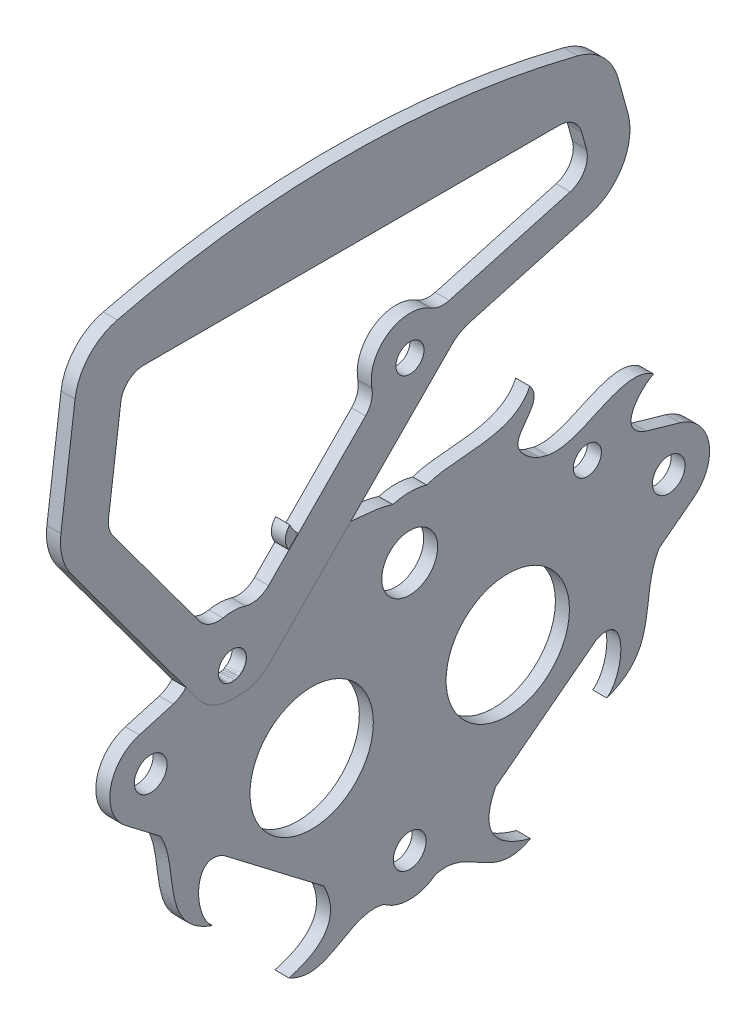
ISO-10303-21;
HEADER;
FILE_DESCRIPTION(('STEP AP214'),'2;1');
FILE_NAME('part.step','',(''),(''),'','','');
FILE_SCHEMA(('AUTOMOTIVE_DESIGN { 1 0 10303 214 1 1 1 1 }'));
ENDSEC;
DATA;
#1=APPLICATION_CONTEXT('core data for automotive mechanical design processes');
#2=APPLICATION_PROTOCOL_DEFINITION('international standard','automotive_design',2000,#1);
#3=PRODUCT_CONTEXT('',#1,'mechanical');
#4=PRODUCT('Part','Part','',(#3));
#5=PRODUCT_RELATED_PRODUCT_CATEGORY('part','',(#4));
#6=PRODUCT_DEFINITION_FORMATION('','',#4);
#7=PRODUCT_DEFINITION_CONTEXT('part definition',#1,'design');
#8=PRODUCT_DEFINITION('design','',#6,#7);
#9=PRODUCT_DEFINITION_SHAPE('','',#8);
#10=(LENGTH_UNIT() NAMED_UNIT(*) SI_UNIT(.MILLI.,.METRE.));
#11=(NAMED_UNIT(*) PLANE_ANGLE_UNIT() SI_UNIT($,.RADIAN.));
#12=(NAMED_UNIT(*) SI_UNIT($,.STERADIAN.) SOLID_ANGLE_UNIT());
#13=UNCERTAINTY_MEASURE_WITH_UNIT(LENGTH_MEASURE(1.E-05),#10,'distance_accuracy_value','');
#14=(GEOMETRIC_REPRESENTATION_CONTEXT(3) GLOBAL_UNCERTAINTY_ASSIGNED_CONTEXT((#13)) GLOBAL_UNIT_ASSIGNED_CONTEXT((#10,
#11,#12)) REPRESENTATION_CONTEXT('',''));
#15=CARTESIAN_POINT('',(0.,0.,0.));
#16=DIRECTION('',(0.,0.,1.));
#17=DIRECTION('',(1.,0.,0.));
#18=AXIS2_PLACEMENT_3D('',#15,#16,#17);
#19=CARTESIAN_POINT('',(1.,49.8809219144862,63.5615063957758));
#20=DIRECTION('',(0.,-0.594086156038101,0.804401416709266));
#21=DIRECTION('',(0.,-0.804401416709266,-0.594086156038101));
#22=AXIS2_PLACEMENT_3D('',#19,#20,#21);
#23=PLANE('',#22);
#24=DIRECTION('',(1.,0.,0.));
#25=VECTOR('',#24,1.);
#26=CARTESIAN_POINT('',(1.,24.8295053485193,45.05992315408));
#27=LINE('',#26,#25);
#28=CARTESIAN_POINT('',(-2.,24.8295053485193,45.05992315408));
#29=VERTEX_POINT('',#28);
#30=CARTESIAN_POINT('',(1.,24.8295053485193,45.05992315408));
#31=VERTEX_POINT('',#30);
#32=EDGE_CURVE('E12',#29,#31,#27,.T.);
#33=ORIENTED_EDGE('',*,*,#32,.F.);
#34=DIRECTION('',(0.,-0.804401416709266,-0.594086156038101));
#35=VECTOR('',#34,1.);
#36=CARTESIAN_POINT('',(-2.,49.8809219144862,63.5615063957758));
#37=LINE('',#36,#35);
#38=CARTESIAN_POINT('',(-2.,49.8809219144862,63.5615063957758));
#39=VERTEX_POINT('',#38);
#40=EDGE_CURVE('E191',#39,#29,#37,.T.);
#41=ORIENTED_EDGE('',*,*,#40,.F.);
#42=DIRECTION('',(1.,0.,0.));
#43=VECTOR('',#42,1.);
#44=CARTESIAN_POINT('',(1.,49.8809219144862,63.5615063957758));
#45=LINE('',#44,#43);
#46=CARTESIAN_POINT('',(1.,49.8809219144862,63.5615063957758));
#47=VERTEX_POINT('',#46);
#48=EDGE_CURVE('E67',#39,#47,#45,.T.);
#49=ORIENTED_EDGE('',*,*,#48,.T.);
#50=DIRECTION('',(0.,-0.804401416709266,-0.594086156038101));
#51=VECTOR('',#50,1.);
#52=CARTESIAN_POINT('',(1.,49.8809219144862,63.5615063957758));
#53=LINE('',#52,#51);
#54=EDGE_CURVE('E322',#47,#31,#53,.T.);
#55=ORIENTED_EDGE('',*,*,#54,.T.);
#56=EDGE_LOOP('',(#33,#41,#49,#55));
#57=FACE_BOUND('',#56,.T.);
#58=ADVANCED_FACE('F57',(#57),#23,.F.);
#59=CARTESIAN_POINT('',(1.,52.8513526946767,59.5394993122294));
#60=DIRECTION('',(1.,0.,0.));
#61=DIRECTION('',(0.,0.,-1.));
#62=AXIS2_PLACEMENT_3D('',#59,#60,#61);
#63=CYLINDRICAL_SURFACE('',#62,5.);
#64=ORIENTED_EDGE('',*,*,#48,.F.);
#65=CARTESIAN_POINT('',(-2.,52.8513526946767,59.5394993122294));
#66=DIRECTION('',(1.,0.,0.));
#67=DIRECTION('',(0.,0.,-1.));
#68=AXIS2_PLACEMENT_3D('',#65,#66,#67);
#69=CIRCLE('',#68,5.);
#70=CARTESIAN_POINT('',(-2.,53.4924963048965,64.4982224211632));
#71=VERTEX_POINT('',#70);
#72=EDGE_CURVE('E237',#71,#39,#69,.T.);
#73=ORIENTED_EDGE('',*,*,#72,.F.);
#74=DIRECTION('',(1.,0.,0.));
#75=VECTOR('',#74,1.);
#76=CARTESIAN_POINT('',(1.,53.4924963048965,64.4982224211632));
#77=LINE('',#76,#75);
#78=CARTESIAN_POINT('',(1.,53.4924963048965,64.4982224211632));
#79=VERTEX_POINT('',#78);
#80=EDGE_CURVE('E315',#71,#79,#77,.T.);
#81=ORIENTED_EDGE('',*,*,#80,.T.);
#82=CARTESIAN_POINT('',(1.,52.8513526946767,59.5394993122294));
#83=DIRECTION('',(1.,0.,0.));
#84=DIRECTION('',(0.,0.,-1.));
#85=AXIS2_PLACEMENT_3D('',#82,#83,#84);
#86=CIRCLE('',#85,5.);
#87=EDGE_CURVE('E332',#79,#47,#86,.T.);
#88=ORIENTED_EDGE('',*,*,#87,.T.);
#89=EDGE_LOOP('',(#64,#73,#81,#88));
#90=FACE_BOUND('',#89,.T.);
#91=ADVANCED_FACE('F335',(#90),#63,.F.);
#92=CARTESIAN_POINT('',(1.,73.8317181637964,61.8684401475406));
#93=DIRECTION('',(0.,0.128228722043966,0.991744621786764));
#94=DIRECTION('',(0.,-0.991744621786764,0.128228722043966));
#95=AXIS2_PLACEMENT_3D('',#92,#93,#94);
#96=PLANE('',#95);
#97=ORIENTED_EDGE('',*,*,#80,.F.);
#98=DIRECTION('',(0.,-0.991744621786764,0.128228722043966));
#99=VECTOR('',#98,1.);
#100=CARTESIAN_POINT('',(-2.,73.8317181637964,61.8684401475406));
#101=LINE('',#100,#99);
#102=CARTESIAN_POINT('',(-2.,73.8317181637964,61.8684401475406));
#103=VERTEX_POINT('',#102);
#104=EDGE_CURVE('E234',#103,#71,#101,.T.);
#105=ORIENTED_EDGE('',*,*,#104,.F.);
#106=DIRECTION('',(1.,0.,0.));
#107=VECTOR('',#106,1.);
#108=CARTESIAN_POINT('',(1.,73.8317181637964,61.8684401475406));
#109=LINE('',#108,#107);
#110=CARTESIAN_POINT('',(1.,73.8317181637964,61.8684401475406));
#111=VERTEX_POINT('',#110);
#112=EDGE_CURVE('E312',#103,#111,#109,.T.);
#113=ORIENTED_EDGE('',*,*,#112,.T.);
#114=DIRECTION('',(0.,-0.991744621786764,0.128228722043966));
#115=VECTOR('',#114,1.);
#116=CARTESIAN_POINT('',(1.,73.8317181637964,61.8684401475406));
#117=LINE('',#116,#115);
#118=EDGE_CURVE('E336',#111,#79,#117,.T.);
#119=ORIENTED_EDGE('',*,*,#118,.T.);
#120=EDGE_LOOP('',(#97,#105,#113,#119));
#121=FACE_BOUND('',#120,.T.);
#122=ADVANCED_FACE('F545',(#121),#96,.F.);
#123=CARTESIAN_POINT('',(1.,73.1905745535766,56.9097170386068));
#124=DIRECTION('',(1.,0.,0.));
#125=DIRECTION('',(0.,0.,-1.));
#126=AXIS2_PLACEMENT_3D('',#123,#124,#125);
#127=CYLINDRICAL_SURFACE('',#126,5.);
#128=ORIENTED_EDGE('',*,*,#112,.F.);
#129=CARTESIAN_POINT('',(-2.,73.1905745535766,56.9097170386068));
#130=DIRECTION('',(1.,0.,0.));
#131=DIRECTION('',(0.,0.,-1.));
#132=AXIS2_PLACEMENT_3D('',#129,#130,#131);
#133=CIRCLE('',#132,5.);
#134=CARTESIAN_POINT('',(-2.,78.1905745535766,56.9097170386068));
#135=VERTEX_POINT('',#134);
#136=EDGE_CURVE('E231',#135,#103,#133,.T.);
#137=ORIENTED_EDGE('',*,*,#136,.F.);
#138=DIRECTION('',(1.,0.,0.));
#139=VECTOR('',#138,1.);
#140=CARTESIAN_POINT('',(1.,78.1905745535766,56.9097170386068));
#141=LINE('',#140,#139);
#142=CARTESIAN_POINT('',(1.,78.1905745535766,56.9097170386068));
#143=VERTEX_POINT('',#142);
#144=EDGE_CURVE('E309',#135,#143,#141,.T.);
#145=ORIENTED_EDGE('',*,*,#144,.T.);
#146=CARTESIAN_POINT('',(1.,73.1905745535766,56.9097170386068));
#147=DIRECTION('',(1.,0.,0.));
#148=DIRECTION('',(0.,0.,-1.));
#149=AXIS2_PLACEMENT_3D('',#146,#147,#148);
#150=CIRCLE('',#149,5.);
#151=EDGE_CURVE('E338',#143,#111,#150,.T.);
#152=ORIENTED_EDGE('',*,*,#151,.T.);
#153=EDGE_LOOP('',(#128,#137,#145,#152));
#154=FACE_BOUND('',#153,.T.);
#155=ADVANCED_FACE('F550',(#154),#127,.F.);
#156=CARTESIAN_POINT('',(1.,78.1905745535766,56.9097170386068));
#157=DIRECTION('',(0.,1.,0.));
#158=DIRECTION('',(0.,0.,1.));
#159=AXIS2_PLACEMENT_3D('',#156,#157,#158);
#160=PLANE('',#159);
#161=ORIENTED_EDGE('',*,*,#144,.F.);
#162=DIRECTION('',(0.,0.,-1.));
#163=VECTOR('',#162,1.);
#164=CARTESIAN_POINT('',(-2.,78.1905745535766,62.7857413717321));
#165=LINE('',#164,#163);
#166=CARTESIAN_POINT('',(-2.,78.1905745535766,-31.9164105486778));
#167=VERTEX_POINT('',#166);
#168=EDGE_CURVE('E228',#167,#135,#165,.F.);
#169=ORIENTED_EDGE('',*,*,#168,.F.);
#170=DIRECTION('',(1.,0.,0.));
#171=VECTOR('',#170,1.);
#172=CARTESIAN_POINT('',(1.,78.1905745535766,-31.9164105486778));
#173=LINE('',#172,#171);
#174=CARTESIAN_POINT('',(1.,78.1905745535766,-31.9164105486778));
#175=VERTEX_POINT('',#174);
#176=EDGE_CURVE('E306',#167,#175,#173,.T.);
#177=ORIENTED_EDGE('',*,*,#176,.T.);
#178=DIRECTION('',(0.,0.,1.));
#179=VECTOR('',#178,1.);
#180=CARTESIAN_POINT('',(1.,78.1905745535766,56.9097170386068));
#181=LINE('',#180,#179);
#182=EDGE_CURVE('E344',#175,#143,#181,.T.);
#183=ORIENTED_EDGE('',*,*,#182,.T.);
#184=EDGE_LOOP('',(#161,#169,#177,#183));
#185=FACE_BOUND('',#184,.T.);
#186=ADVANCED_FACE('F554',(#185),#160,.F.);
#187=CARTESIAN_POINT('',(1.,73.1905745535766,-31.9164105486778));
#188=DIRECTION('',(1.,0.,0.));
#189=DIRECTION('',(0.,0.,-1.));
#190=AXIS2_PLACEMENT_3D('',#187,#188,#189);
#191=CYLINDRICAL_SURFACE('',#190,5.);
#192=ORIENTED_EDGE('',*,*,#176,.F.);
#193=CARTESIAN_POINT('',(-2.,73.1905745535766,-31.9164105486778));
#194=DIRECTION('',(1.,0.,0.));
#195=DIRECTION('',(0.,0.,-1.));
#196=AXIS2_PLACEMENT_3D('',#193,#194,#195);
#197=CIRCLE('',#196,5.);
#198=CARTESIAN_POINT('',(-2.,74.528793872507,-36.7340000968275));
#199=VERTEX_POINT('',#198);
#200=EDGE_CURVE('E225',#199,#167,#197,.T.);
#201=ORIENTED_EDGE('',*,*,#200,.F.);
#202=DIRECTION('',(1.,0.,0.));
#203=VECTOR('',#202,1.);
#204=CARTESIAN_POINT('',(1.,74.528793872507,-36.7340000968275));
#205=LINE('',#204,#203);
#206=CARTESIAN_POINT('',(1.,74.528793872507,-36.7340000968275));
#207=VERTEX_POINT('',#206);
#208=EDGE_CURVE('E303',#199,#207,#205,.T.);
#209=ORIENTED_EDGE('',*,*,#208,.T.);
#210=CARTESIAN_POINT('',(1.,73.1905745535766,-31.9164105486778));
#211=DIRECTION('',(1.,0.,0.));
#212=DIRECTION('',(0.,0.,1.));
#213=AXIS2_PLACEMENT_3D('',#210,#211,#212);
#214=CIRCLE('',#213,5.);
#215=EDGE_CURVE('E347',#207,#175,#214,.T.);
#216=ORIENTED_EDGE('',*,*,#215,.T.);
#217=EDGE_LOOP('',(#192,#201,#209,#216));
#218=FACE_BOUND('',#217,.T.);
#219=ADVANCED_FACE('F558',(#218),#191,.F.);
#220=CARTESIAN_POINT('',(1.,74.528793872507,-36.7340000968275));
#221=DIRECTION('',(0.,0.267643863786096,-0.96351790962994));
#222=DIRECTION('',(0.,0.96351790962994,0.267643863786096));
#223=AXIS2_PLACEMENT_3D('',#220,#221,#222);
#224=PLANE('',#223);
#225=ORIENTED_EDGE('',*,*,#208,.F.);
#226=DIRECTION('',(0.,0.96351790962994,0.267643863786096));
#227=VECTOR('',#226,1.);
#228=CARTESIAN_POINT('',(-2.,74.528793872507,-36.7340000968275));
#229=LINE('',#228,#227);
#230=CARTESIAN_POINT('',(-2.,70.8566969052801,-37.7540270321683));
#231=VERTEX_POINT('',#230);
#232=EDGE_CURVE('E222',#231,#199,#229,.T.);
#233=ORIENTED_EDGE('',*,*,#232,.F.);
#234=DIRECTION('',(1.,0.,0.));
#235=VECTOR('',#234,1.);
#236=CARTESIAN_POINT('',(1.,70.8566969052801,-37.7540270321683));
#237=LINE('',#236,#235);
#238=CARTESIAN_POINT('',(1.,70.8566969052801,-37.7540270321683));
#239=VERTEX_POINT('',#238);
#240=EDGE_CURVE('E300',#231,#239,#237,.T.);
#241=ORIENTED_EDGE('',*,*,#240,.T.);
#242=DIRECTION('',(0.,0.96351790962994,0.267643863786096));
#243=VECTOR('',#242,1.);
#244=CARTESIAN_POINT('',(1.,74.528793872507,-36.7340000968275));
#245=LINE('',#244,#243);
#246=EDGE_CURVE('E350',#239,#207,#245,.T.);
#247=ORIENTED_EDGE('',*,*,#246,.T.);
#248=EDGE_LOOP('',(#225,#233,#241,#247));
#249=FACE_BOUND('',#248,.T.);
#250=ADVANCED_FACE('F562',(#249),#224,.F.);
#251=CARTESIAN_POINT('',(1.,69.5184775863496,-32.9364374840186));
#252=DIRECTION('',(1.,0.,0.));
#253=DIRECTION('',(0.,0.,-1.));
#254=AXIS2_PLACEMENT_3D('',#251,#252,#253);
#255=CYLINDRICAL_SURFACE('',#254,4.99999999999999);
#256=ORIENTED_EDGE('',*,*,#240,.F.);
#257=CARTESIAN_POINT('',(-2.,69.5184775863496,-32.9364374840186));
#258=DIRECTION('',(1.,0.,0.));
#259=DIRECTION('',(0.,0.,-1.));
#260=AXIS2_PLACEMENT_3D('',#257,#258,#259);
#261=CIRCLE('',#260,4.99999999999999);
#262=CARTESIAN_POINT('',(-2.,64.7008880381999,-34.2746568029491));
#263=VERTEX_POINT('',#262);
#264=EDGE_CURVE('E219',#263,#231,#261,.T.);
#265=ORIENTED_EDGE('',*,*,#264,.F.);
#266=DIRECTION('',(1.,0.,0.));
#267=VECTOR('',#266,1.);
#268=CARTESIAN_POINT('',(1.,64.7008880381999,-34.2746568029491));
#269=LINE('',#268,#267);
#270=CARTESIAN_POINT('',(1.,64.7008880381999,-34.2746568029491));
#271=VERTEX_POINT('',#270);
#272=EDGE_CURVE('E297',#263,#271,#269,.T.);
#273=ORIENTED_EDGE('',*,*,#272,.T.);
#274=CARTESIAN_POINT('',(1.,69.5184775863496,-32.9364374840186));
#275=DIRECTION('',(1.,0.,0.));
#276=DIRECTION('',(0.,0.,1.));
#277=AXIS2_PLACEMENT_3D('',#274,#275,#276);
#278=CIRCLE('',#277,4.99999999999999);
#279=EDGE_CURVE('E353',#271,#239,#278,.T.);
#280=ORIENTED_EDGE('',*,*,#279,.T.);
#281=EDGE_LOOP('',(#256,#265,#273,#280));
#282=FACE_BOUND('',#281,.T.);
#283=ADVANCED_FACE('F566',(#282),#255,.F.);
#284=CARTESIAN_POINT('',(1.,64.7008880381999,-34.2746568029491));
#285=DIRECTION('',(0.,-0.963517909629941,-0.267643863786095));
#286=DIRECTION('',(0.,0.267643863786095,-0.96351790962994));
#287=AXIS2_PLACEMENT_3D('',#284,#285,#286);
#288=PLANE('',#287);
#289=ORIENTED_EDGE('',*,*,#272,.F.);
#290=DIRECTION('',(0.,0.267643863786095,-0.96351790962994));
#291=VECTOR('',#290,1.);
#292=CARTESIAN_POINT('',(-2.,64.7008880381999,-34.2746568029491));
#293=LINE('',#292,#291);
#294=CARTESIAN_POINT('',(-2.,57.5138764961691,-8.40141525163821));
#295=VERTEX_POINT('',#294);
#296=EDGE_CURVE('E216',#295,#263,#293,.T.);
#297=ORIENTED_EDGE('',*,*,#296,.F.);
#298=DIRECTION('',(1.,0.,0.));
#299=VECTOR('',#298,1.);
#300=CARTESIAN_POINT('',(1.,57.5138764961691,-8.40141525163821));
#301=LINE('',#300,#299);
#302=CARTESIAN_POINT('',(1.,57.5138764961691,-8.40141525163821));
#303=VERTEX_POINT('',#302);
#304=EDGE_CURVE('E294',#295,#303,#301,.T.);
#305=ORIENTED_EDGE('',*,*,#304,.T.);
#306=DIRECTION('',(0.,0.267643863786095,-0.96351790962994));
#307=VECTOR('',#306,1.);
#308=CARTESIAN_POINT('',(1.,64.7008880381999,-34.2746568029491));
#309=LINE('',#308,#307);
#310=EDGE_CURVE('E356',#303,#271,#309,.T.);
#311=ORIENTED_EDGE('',*,*,#310,.T.);
#312=EDGE_LOOP('',(#289,#297,#305,#311));
#313=FACE_BOUND('',#312,.T.);
#314=ADVANCED_FACE('F570',(#313),#288,.F.);
#315=CARTESIAN_POINT('',(1.,62.3314660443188,-7.06319593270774));
#316=DIRECTION('',(1.,0.,0.));
#317=DIRECTION('',(0.,0.,-1.));
#318=AXIS2_PLACEMENT_3D('',#315,#316,#317);
#319=CYLINDRICAL_SURFACE('',#318,5.);
#320=ORIENTED_EDGE('',*,*,#304,.F.);
#321=CARTESIAN_POINT('',(-2.,62.3314660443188,-7.06319593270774));
#322=DIRECTION('',(1.,0.,0.));
#323=DIRECTION('',(0.,0.,-1.));
#324=AXIS2_PLACEMENT_3D('',#321,#322,#323);
#325=CIRCLE('',#324,5.);
#326=CARTESIAN_POINT('',(-2.,58.0952690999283,-4.40713956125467));
#327=VERTEX_POINT('',#326);
#328=EDGE_CURVE('E213',#327,#295,#325,.T.);
#329=ORIENTED_EDGE('',*,*,#328,.F.);
#330=DIRECTION('',(1.,0.,0.));
#331=VECTOR('',#330,1.);
#332=CARTESIAN_POINT('',(1.,58.0952690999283,-4.40713956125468));
#333=LINE('',#332,#331);
#334=CARTESIAN_POINT('',(1.,58.0952690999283,-4.40713956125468));
#335=VERTEX_POINT('',#334);
#336=EDGE_CURVE('E291',#327,#335,#333,.T.);
#337=ORIENTED_EDGE('',*,*,#336,.T.);
#338=CARTESIAN_POINT('',(1.,62.3314660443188,-7.06319593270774));
#339=DIRECTION('',(1.,0.,0.));
#340=DIRECTION('',(0.,0.,1.));
#341=AXIS2_PLACEMENT_3D('',#338,#339,#340);
#342=CIRCLE('',#341,5.);
#343=EDGE_CURVE('E359',#335,#303,#342,.T.);
#344=ORIENTED_EDGE('',*,*,#343,.T.);
#345=EDGE_LOOP('',(#320,#329,#337,#344));
#346=FACE_BOUND('',#345,.T.);
#347=ADVANCED_FACE('F574',(#346),#319,.F.);
#348=CARTESIAN_POINT('',(1.,51.0651808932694,0.000660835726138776));
#349=DIRECTION('',(-1.,0.,0.));
#350=DIRECTION('',(0.,0.,1.));
#351=AXIS2_PLACEMENT_3D('',#348,#349,#350);
#352=CYLINDRICAL_SURFACE('',#351,8.29764090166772);
#353=ORIENTED_EDGE('',*,*,#336,.F.);
#354=CARTESIAN_POINT('',(-2.,51.0651808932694,0.000660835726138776));
#355=DIRECTION('',(-1.,0.,0.));
#356=DIRECTION('',(0.,0.,1.));
#357=AXIS2_PLACEMENT_3D('',#354,#355,#356);
#358=CIRCLE('',#357,8.29764090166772);
#359=CARTESIAN_POINT('',(-2.,49.509719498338,8.15120587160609));
#360=VERTEX_POINT('',#359);
#361=EDGE_CURVE('E210',#360,#327,#358,.T.);
#362=ORIENTED_EDGE('',*,*,#361,.F.);
#363=DIRECTION('',(1.,0.,0.));
#364=VECTOR('',#363,1.);
#365=CARTESIAN_POINT('',(1.,49.509719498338,8.15120587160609));
#366=LINE('',#365,#364);
#367=CARTESIAN_POINT('',(1.,49.509719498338,8.15120587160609));
#368=VERTEX_POINT('',#367);
#369=EDGE_CURVE('E288',#360,#368,#366,.T.);
#370=ORIENTED_EDGE('',*,*,#369,.T.);
#371=CARTESIAN_POINT('',(1.,51.0651808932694,0.000660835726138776));
#372=DIRECTION('',(-1.,0.,0.));
#373=DIRECTION('',(0.,0.,-1.));
#374=AXIS2_PLACEMENT_3D('',#371,#372,#373);
#375=CIRCLE('',#374,8.29764090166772);
#376=EDGE_CURVE('E362',#368,#335,#375,.T.);
#377=ORIENTED_EDGE('',*,*,#376,.T.);
#378=EDGE_LOOP('',(#353,#362,#370,#377));
#379=FACE_BOUND('',#378,.T.);
#380=ADVANCED_FACE('F578',(#379),#352,.T.);
#381=CARTESIAN_POINT('',(1.,48.572428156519,13.0625687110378));
#382=DIRECTION('',(1.,0.,0.));
#383=DIRECTION('',(0.,0.,-1.));
#384=AXIS2_PLACEMENT_3D('',#381,#382,#383);
#385=CYLINDRICAL_SURFACE('',#384,5.);
#386=ORIENTED_EDGE('',*,*,#369,.F.);
#387=CARTESIAN_POINT('',(-2.,48.572428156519,13.0625687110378));
#388=DIRECTION('',(1.,0.,0.));
#389=DIRECTION('',(0.,0.,-1.));
#390=AXIS2_PLACEMENT_3D('',#387,#388,#389);
#391=CIRCLE('',#390,5.);
#392=CARTESIAN_POINT('',(-2.,45.0631841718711,9.50093893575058));
#393=VERTEX_POINT('',#392);
#394=EDGE_CURVE('E207',#393,#360,#391,.T.);
#395=ORIENTED_EDGE('',*,*,#394,.F.);
#396=DIRECTION('',(1.,0.,0.));
#397=VECTOR('',#396,1.);
#398=CARTESIAN_POINT('',(1.,45.0631841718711,9.50093893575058));
#399=LINE('',#398,#397);
#400=CARTESIAN_POINT('',(1.,45.0631841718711,9.50093893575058));
#401=VERTEX_POINT('',#400);
#402=EDGE_CURVE('E285',#393,#401,#399,.T.);
#403=ORIENTED_EDGE('',*,*,#402,.T.);
#404=CARTESIAN_POINT('',(1.,48.572428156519,13.0625687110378));
#405=DIRECTION('',(1.,0.,0.));
#406=DIRECTION('',(0.,0.,-1.));
#407=AXIS2_PLACEMENT_3D('',#404,#405,#406);
#408=CIRCLE('',#407,5.);
#409=EDGE_CURVE('E365',#401,#368,#408,.T.);
#410=ORIENTED_EDGE('',*,*,#409,.T.);
#411=EDGE_LOOP('',(#386,#395,#403,#410));
#412=FACE_BOUND('',#411,.T.);
#413=ADVANCED_FACE('F466',(#412),#385,.F.);
#414=CARTESIAN_POINT('',(1.,45.0631841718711,9.50093893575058));
#415=DIRECTION('',(0.,-0.701848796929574,-0.712325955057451));
#416=DIRECTION('',(0.,0.71232595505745,-0.701848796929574));
#417=AXIS2_PLACEMENT_3D('',#414,#415,#416);
#418=PLANE('',#417);
#419=ORIENTED_EDGE('',*,*,#402,.F.);
#420=DIRECTION('',(0.,0.71232595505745,-0.701848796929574));
#421=VECTOR('',#420,1.);
#422=CARTESIAN_POINT('',(-2.,45.0631841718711,9.50093893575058));
#423=LINE('',#422,#421);
#424=CARTESIAN_POINT('',(-2.,24.0052537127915,30.2491414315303));
#425=VERTEX_POINT('',#424);
#426=EDGE_CURVE('E204',#425,#393,#423,.T.);
#427=ORIENTED_EDGE('',*,*,#426,.F.);
#428=DIRECTION('',(1.,0.,0.));
#429=VECTOR('',#428,1.);
#430=CARTESIAN_POINT('',(1.,24.0052537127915,30.2491414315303));
#431=LINE('',#430,#429);
#432=CARTESIAN_POINT('',(1.,24.0052537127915,30.2491414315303));
#433=VERTEX_POINT('',#432);
#434=EDGE_CURVE('E283',#425,#433,#431,.T.);
#435=ORIENTED_EDGE('',*,*,#434,.T.);
#436=DIRECTION('',(0.,0.71232595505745,-0.701848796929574));
#437=VECTOR('',#436,1.);
#438=CARTESIAN_POINT('',(1.,45.0631841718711,9.50093893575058));
#439=LINE('',#438,#437);
#440=EDGE_CURVE('E368',#433,#401,#439,.T.);
#441=ORIENTED_EDGE('',*,*,#440,.T.);
#442=EDGE_LOOP('',(#419,#427,#435,#441));
#443=FACE_BOUND('',#442,.T.);
#444=ADVANCED_FACE('F473',(#443),#418,.F.);
#445=CARTESIAN_POINT('',(1.,27.5144976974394,33.8107712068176));
#446=DIRECTION('',(1.,0.,0.));
#447=DIRECTION('',(0.,0.,-1.));
#448=AXIS2_PLACEMENT_3D('',#445,#446,#447);
#449=CYLINDRICAL_SURFACE('',#448,5.);
#450=ORIENTED_EDGE('',*,*,#434,.F.);
#451=CARTESIAN_POINT('',(-2.,27.5144976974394,33.8107712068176));
#452=DIRECTION('',(1.,0.,0.));
#453=DIRECTION('',(0.,0.,-1.));
#454=AXIS2_PLACEMENT_3D('',#451,#452,#453);
#455=CIRCLE('',#454,5.);
#456=CARTESIAN_POINT('',(-2.,22.7123153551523,35.2032670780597));
#457=VERTEX_POINT('',#456);
#458=EDGE_CURVE('E201',#457,#425,#455,.T.);
#459=ORIENTED_EDGE('',*,*,#458,.F.);
#460=DIRECTION('',(1.,0.,0.));
#461=VECTOR('',#460,1.);
#462=CARTESIAN_POINT('',(1.,22.7123153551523,35.2032670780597));
#463=LINE('',#462,#461);
#464=CARTESIAN_POINT('',(1.,22.7123153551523,35.2032670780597));
#465=VERTEX_POINT('',#464);
#466=EDGE_CURVE('E75',#457,#465,#463,.T.);
#467=ORIENTED_EDGE('',*,*,#466,.T.);
#468=CARTESIAN_POINT('',(1.,27.5144976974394,33.8107712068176));
#469=DIRECTION('',(1.,0.,0.));
#470=DIRECTION('',(0.,0.,1.));
#471=AXIS2_PLACEMENT_3D('',#468,#469,#470);
#472=CIRCLE('',#471,5.);
#473=EDGE_CURVE('E281',#465,#433,#472,.T.);
#474=ORIENTED_EDGE('',*,*,#473,.T.);
#475=EDGE_LOOP('',(#450,#459,#467,#474));
#476=FACE_BOUND('',#475,.T.);
#477=ADVANCED_FACE('F474',(#476),#449,.F.);
#478=CARTESIAN_POINT('',(1.,13.0651808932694,38.0006608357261));
#479=DIRECTION('',(-1.,0.,0.));
#480=DIRECTION('',(0.,0.,1.));
#481=AXIS2_PLACEMENT_3D('',#478,#479,#480);
#482=CYLINDRICAL_SURFACE('',#481,10.0445316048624);
#483=ORIENTED_EDGE('',*,*,#466,.F.);
#484=CARTESIAN_POINT('',(-2.,13.0651808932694,38.0006608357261));
#485=DIRECTION('',(-1.,0.,0.));
#486=DIRECTION('',(0.,0.,1.));
#487=AXIS2_PLACEMENT_3D('',#484,#485,#486);
#488=CIRCLE('',#487,10.0445316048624);
#489=CARTESIAN_POINT('',(-2.,22.9028892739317,40.0284944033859));
#490=VERTEX_POINT('',#489);
#491=EDGE_CURVE('E189',#490,#457,#488,.T.);
#492=ORIENTED_EDGE('',*,*,#491,.F.);
#493=DIRECTION('',(1.,0.,0.));
#494=VECTOR('',#493,1.);
#495=CARTESIAN_POINT('',(1.,22.9028892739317,40.0284944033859));
#496=LINE('',#495,#494);
#497=CARTESIAN_POINT('',(1.,22.9028892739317,40.0284944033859));
#498=VERTEX_POINT('',#497);
#499=EDGE_CURVE('E61',#490,#498,#496,.T.);
#500=ORIENTED_EDGE('',*,*,#499,.T.);
#501=CARTESIAN_POINT('',(1.,13.0651808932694,38.0006608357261));
#502=DIRECTION('',(-1.,0.,0.));
#503=DIRECTION('',(0.,0.,-1.));
#504=AXIS2_PLACEMENT_3D('',#501,#502,#503);
#505=CIRCLE('',#504,10.0445316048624);
#506=EDGE_CURVE('E475',#498,#465,#505,.T.);
#507=ORIENTED_EDGE('',*,*,#506,.T.);
#508=EDGE_LOOP('',(#483,#492,#500,#507));
#509=FACE_BOUND('',#508,.T.);
#510=ADVANCED_FACE('F193',(#509),#482,.T.);
#511=CARTESIAN_POINT('',(1.,15.8457381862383,38.1058779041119));
#512=DIRECTION('',(1.,0.,0.));
#513=DIRECTION('',(0.,0.,-1.));
#514=AXIS2_PLACEMENT_3D('',#511,#512,#513);
#515=CYLINDRICAL_SURFACE('',#514,9.);
#516=DIRECTION('',(1.,0.,0.));
#517=VECTOR('',#516,1.);
#518=CARTESIAN_POINT('',(1.,10.4989627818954,45.3454906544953));
#519=LINE('',#518,#517);
#520=CARTESIAN_POINT('',(-2.,10.4989627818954,45.3454906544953));
#521=VERTEX_POINT('',#520);
#522=CARTESIAN_POINT('',(1.,10.4989627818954,45.3454906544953));
#523=VERTEX_POINT('',#522);
#524=EDGE_CURVE('E184',#521,#523,#519,.T.);
#525=ORIENTED_EDGE('',*,*,#524,.F.);
#526=CARTESIAN_POINT('',(-2.,15.8457381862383,38.1058779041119));
#527=DIRECTION('',(1.,0.,0.));
#528=DIRECTION('',(0.,0.,-1.));
#529=AXIS2_PLACEMENT_3D('',#526,#527,#528);
#530=CIRCLE('',#529,9.);
#531=CARTESIAN_POINT('',(-2.,6.84573818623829,38.1058779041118));
#532=VERTEX_POINT('',#531);
#533=EDGE_CURVE('E411',#521,#532,#530,.T.);
#534=ORIENTED_EDGE('',*,*,#533,.T.);
#535=DIRECTION('',(1.,0.,0.));
#536=VECTOR('',#535,1.);
#537=CARTESIAN_POINT('',(1.,6.84573818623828,38.1058779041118));
#538=LINE('',#537,#536);
#539=CARTESIAN_POINT('',(1.,6.84573818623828,38.1058779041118));
#540=VERTEX_POINT('',#539);
#541=EDGE_CURVE('E274',#532,#540,#538,.T.);
#542=ORIENTED_EDGE('',*,*,#541,.T.);
#543=CARTESIAN_POINT('',(1.,15.8457381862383,38.1058779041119));
#544=DIRECTION('',(1.,0.,0.));
#545=DIRECTION('',(0.,0.,-1.));
#546=AXIS2_PLACEMENT_3D('',#543,#544,#545);
#547=CIRCLE('',#546,9.);
#548=EDGE_CURVE('E512',#523,#540,#547,.T.);
#549=ORIENTED_EDGE('',*,*,#548,.F.);
#550=EDGE_LOOP('',(#525,#534,#542,#549));
#551=FACE_BOUND('',#550,.T.);
#552=ADVANCED_FACE('F590',(#551),#515,.T.);
#553=CARTESIAN_POINT('',(1.,6.84573818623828,38.1058779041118));
#554=DIRECTION('',(0.,-1.,0.));
#555=DIRECTION('',(0.,0.,-1.));
#556=AXIS2_PLACEMENT_3D('',#553,#554,#555);
#557=PLANE('',#556);
#558=ORIENTED_EDGE('',*,*,#541,.F.);
#559=DIRECTION('',(0.,0.,-1.));
#560=VECTOR('',#559,1.);
#561=CARTESIAN_POINT('',(-2.,6.84573818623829,62.7857413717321));
#562=LINE('',#561,#560);
#563=CARTESIAN_POINT('',(-2.,6.84573818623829,36.4186262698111));
#564=VERTEX_POINT('',#563);
#565=EDGE_CURVE('E408',#532,#564,#562,.T.);
#566=ORIENTED_EDGE('',*,*,#565,.T.);
#567=DIRECTION('',(1.,0.,0.));
#568=VECTOR('',#567,1.);
#569=CARTESIAN_POINT('',(1.,6.84573818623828,36.4186262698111));
#570=LINE('',#569,#568);
#571=CARTESIAN_POINT('',(1.,6.84573818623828,36.4186262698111));
#572=VERTEX_POINT('',#571);
#573=EDGE_CURVE('E271',#564,#572,#570,.T.);
#574=ORIENTED_EDGE('',*,*,#573,.T.);
#575=DIRECTION('',(0.,0.,-1.));
#576=VECTOR('',#575,1.);
#577=CARTESIAN_POINT('',(1.,6.84573818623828,38.1058779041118));
#578=LINE('',#577,#576);
#579=EDGE_CURVE('E509',#540,#572,#578,.T.);
#580=ORIENTED_EDGE('',*,*,#579,.F.);
#581=EDGE_LOOP('',(#558,#566,#574,#580));
#582=FACE_BOUND('',#581,.T.);
#583=ADVANCED_FACE('F596',(#582),#557,.T.);
#584=CARTESIAN_POINT('',(1.,15.8457381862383,36.418626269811));
#585=DIRECTION('',(1.,0.,0.));
#586=DIRECTION('',(0.,0.,-1.));
#587=AXIS2_PLACEMENT_3D('',#584,#585,#586);
#588=CYLINDRICAL_SURFACE('',#587,9.);
#589=ORIENTED_EDGE('',*,*,#573,.F.);
#590=CARTESIAN_POINT('',(-2.,15.8457381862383,36.418626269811));
#591=DIRECTION('',(1.,0.,0.));
#592=DIRECTION('',(0.,0.,-1.));
#593=AXIS2_PLACEMENT_3D('',#590,#591,#592);
#594=CIRCLE('',#593,9.);
#595=CARTESIAN_POINT('',(-2.,9.52909901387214,30.007692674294));
#596=VERTEX_POINT('',#595);
#597=EDGE_CURVE('E405',#564,#596,#594,.T.);
#598=ORIENTED_EDGE('',*,*,#597,.T.);
#599=DIRECTION('',(1.,0.,0.));
#600=VECTOR('',#599,1.);
#601=CARTESIAN_POINT('',(1.,9.52909901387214,30.007692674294));
#602=LINE('',#601,#600);
#603=CARTESIAN_POINT('',(1.,9.52909901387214,30.007692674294));
#604=VERTEX_POINT('',#603);
#605=EDGE_CURVE('E268',#596,#604,#602,.T.);
#606=ORIENTED_EDGE('',*,*,#605,.T.);
#607=CARTESIAN_POINT('',(1.,15.8457381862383,36.418626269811));
#608=DIRECTION('',(1.,0.,0.));
#609=DIRECTION('',(0.,0.,1.));
#610=AXIS2_PLACEMENT_3D('',#607,#608,#609);
#611=CIRCLE('',#610,9.);
#612=EDGE_CURVE('E506',#572,#604,#611,.T.);
#613=ORIENTED_EDGE('',*,*,#612,.F.);
#614=EDGE_LOOP('',(#589,#598,#606,#613));
#615=FACE_BOUND('',#614,.T.);
#616=ADVANCED_FACE('F600',(#615),#588,.T.);
#617=CARTESIAN_POINT('',(1.,9.52909901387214,30.007692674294));
#618=DIRECTION('',(0.,-0.701848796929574,-0.712325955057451));
#619=DIRECTION('',(0.,0.712325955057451,-0.701848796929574));
#620=AXIS2_PLACEMENT_3D('',#617,#618,#619);
#621=PLANE('',#620);
#622=ORIENTED_EDGE('',*,*,#605,.F.);
#623=DIRECTION('',(0.,0.712325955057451,-0.701848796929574));
#624=VECTOR('',#623,1.);
#625=CARTESIAN_POINT('',(-2.,9.52909901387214,30.007692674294));
#626=LINE('',#625,#624);
#627=CARTESIAN_POINT('',(-2.,48.8983105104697,-8.78246164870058));
#628=VERTEX_POINT('',#627);
#629=EDGE_CURVE('E402',#596,#628,#626,.T.);
#630=ORIENTED_EDGE('',*,*,#629,.T.);
#631=DIRECTION('',(1.,0.,0.));
#632=VECTOR('',#631,1.);
#633=CARTESIAN_POINT('',(1.,48.8983105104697,-8.78246164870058));
#634=LINE('',#633,#632);
#635=CARTESIAN_POINT('',(1.,48.8983105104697,-8.78246164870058));
#636=VERTEX_POINT('',#635);
#637=EDGE_CURVE('E265',#628,#636,#634,.T.);
#638=ORIENTED_EDGE('',*,*,#637,.T.);
#639=DIRECTION('',(0.,0.712325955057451,-0.701848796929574));
#640=VECTOR('',#639,1.);
#641=CARTESIAN_POINT('',(1.,9.52909901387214,30.007692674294));
#642=LINE('',#641,#640);
#643=EDGE_CURVE('E503',#604,#636,#642,.T.);
#644=ORIENTED_EDGE('',*,*,#643,.F.);
#645=EDGE_LOOP('',(#622,#630,#638,#644));
#646=FACE_BOUND('',#645,.T.);
#647=ADVANCED_FACE('F604',(#646),#621,.T.);
#648=CARTESIAN_POINT('',(1.,42.5816713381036,-15.1933952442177));
#649=DIRECTION('',(-1.,0.,0.));
#650=DIRECTION('',(0.,0.,1.));
#651=AXIS2_PLACEMENT_3D('',#648,#649,#650);
#652=CYLINDRICAL_SURFACE('',#651,9.00000000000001);
#653=ORIENTED_EDGE('',*,*,#637,.F.);
#654=CARTESIAN_POINT('',(-2.,42.5816713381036,-15.1933952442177));
#655=DIRECTION('',(-1.,0.,0.));
#656=DIRECTION('',(0.,0.,1.));
#657=AXIS2_PLACEMENT_3D('',#654,#655,#656);
#658=CIRCLE('',#657,9.00000000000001);
#659=CARTESIAN_POINT('',(-2.,51.2533325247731,-12.7846004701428));
#660=VERTEX_POINT('',#659);
#661=EDGE_CURVE('E399',#628,#660,#658,.T.);
#662=ORIENTED_EDGE('',*,*,#661,.T.);
#663=DIRECTION('',(1.,0.,0.));
#664=VECTOR('',#663,1.);
#665=CARTESIAN_POINT('',(1.,51.2533325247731,-12.7846004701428));
#666=LINE('',#665,#664);
#667=CARTESIAN_POINT('',(1.,51.2533325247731,-12.7846004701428));
#668=VERTEX_POINT('',#667);
#669=EDGE_CURVE('E262',#660,#668,#666,.T.);
#670=ORIENTED_EDGE('',*,*,#669,.T.);
#671=CARTESIAN_POINT('',(1.,42.5816713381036,-15.1933952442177));
#672=DIRECTION('',(-1.,0.,0.));
#673=DIRECTION('',(0.,0.,1.));
#674=AXIS2_PLACEMENT_3D('',#671,#672,#673);
#675=CIRCLE('',#674,9.00000000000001);
#676=EDGE_CURVE('E500',#636,#668,#675,.T.);
#677=ORIENTED_EDGE('',*,*,#676,.F.);
#678=EDGE_LOOP('',(#653,#662,#670,#677));
#679=FACE_BOUND('',#678,.T.);
#680=ADVANCED_FACE('F608',(#679),#652,.F.);
#681=CARTESIAN_POINT('',(1.,51.2533325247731,-12.7846004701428));
#682=DIRECTION('',(0.,-0.963517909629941,-0.267643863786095));
#683=DIRECTION('',(0.,0.267643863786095,-0.96351790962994));
#684=AXIS2_PLACEMENT_3D('',#681,#682,#683);
#685=PLANE('',#684);
#686=ORIENTED_EDGE('',*,*,#669,.F.);
#687=DIRECTION('',(0.,0.267643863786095,-0.96351790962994));
#688=VECTOR('',#687,1.);
#689=CARTESIAN_POINT('',(-2.,51.2533325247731,-12.7846004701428));
#690=LINE('',#689,#688);
#691=CARTESIAN_POINT('',(-2.,58.3340613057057,-38.2752240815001));
#692=VERTEX_POINT('',#691);
#693=EDGE_CURVE('E396',#660,#692,#690,.T.);
#694=ORIENTED_EDGE('',*,*,#693,.T.);
#695=DIRECTION('',(1.,0.,0.));
#696=VECTOR('',#695,1.);
#697=CARTESIAN_POINT('',(1.,58.3340613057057,-38.2752240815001));
#698=LINE('',#697,#696);
#699=CARTESIAN_POINT('',(1.,58.3340613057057,-38.2752240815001));
#700=VERTEX_POINT('',#699);
#701=EDGE_CURVE('E259',#692,#700,#698,.T.);
#702=ORIENTED_EDGE('',*,*,#701,.T.);
#703=DIRECTION('',(0.,0.267643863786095,-0.96351790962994));
#704=VECTOR('',#703,1.);
#705=CARTESIAN_POINT('',(1.,51.2533325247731,-12.7846004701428));
#706=LINE('',#705,#704);
#707=EDGE_CURVE('E497',#668,#700,#706,.T.);
#708=ORIENTED_EDGE('',*,*,#707,.F.);
#709=EDGE_LOOP('',(#686,#694,#702,#708));
#710=FACE_BOUND('',#709,.T.);
#711=ADVANCED_FACE('F612',(#710),#685,.T.);
#712=CARTESIAN_POINT('',(1.,69.896276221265,-35.0634977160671));
#713=DIRECTION('',(1.,0.,0.));
#714=DIRECTION('',(0.,0.,-1.));
#715=AXIS2_PLACEMENT_3D('',#712,#713,#714);
#716=CYLINDRICAL_SURFACE('',#715,12.);
#717=ORIENTED_EDGE('',*,*,#701,.F.);
#718=CARTESIAN_POINT('',(-2.,69.896276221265,-35.0634977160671));
#719=DIRECTION('',(1.,0.,0.));
#720=DIRECTION('',(0.,0.,-1.));
#721=AXIS2_PLACEMENT_3D('',#718,#719,#720);
#722=CIRCLE('',#721,12.);
#723=CARTESIAN_POINT('',(-2.,73.1080025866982,-46.6257126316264));
#724=VERTEX_POINT('',#723);
#725=EDGE_CURVE('E393',#692,#724,#722,.T.);
#726=ORIENTED_EDGE('',*,*,#725,.T.);
#727=DIRECTION('',(1.,0.,0.));
#728=VECTOR('',#727,1.);
#729=CARTESIAN_POINT('',(1.,73.1080025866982,-46.6257126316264));
#730=LINE('',#729,#728);
#731=CARTESIAN_POINT('',(1.,73.1080025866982,-46.6257126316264));
#732=VERTEX_POINT('',#731);
#733=EDGE_CURVE('E256',#724,#732,#730,.T.);
#734=ORIENTED_EDGE('',*,*,#733,.T.);
#735=CARTESIAN_POINT('',(1.,69.896276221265,-35.0634977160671));
#736=DIRECTION('',(1.,0.,0.));
#737=DIRECTION('',(0.,0.,-1.));
#738=AXIS2_PLACEMENT_3D('',#735,#736,#737);
#739=CIRCLE('',#738,12.);
#740=EDGE_CURVE('E494',#700,#732,#739,.T.);
#741=ORIENTED_EDGE('',*,*,#740,.F.);
#742=EDGE_LOOP('',(#717,#726,#734,#741));
#743=FACE_BOUND('',#742,.T.);
#744=ADVANCED_FACE('F616',(#743),#716,.T.);
#745=CARTESIAN_POINT('',(1.,73.1080025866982,-46.6257126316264));
#746=DIRECTION('',(0.,0.267643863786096,-0.96351790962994));
#747=DIRECTION('',(0.,0.96351790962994,0.267643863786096));
#748=AXIS2_PLACEMENT_3D('',#745,#746,#747);
#749=PLANE('',#748);
#750=ORIENTED_EDGE('',*,*,#733,.F.);
#751=DIRECTION('',(0.,0.96351790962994,0.267643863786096));
#752=VECTOR('',#751,1.);
#753=CARTESIAN_POINT('',(-2.,73.1080025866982,-46.6257126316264));
#754=LINE('',#753,#752);
#755=CARTESIAN_POINT('',(-2.,80.6703210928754,-44.5250686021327));
#756=VERTEX_POINT('',#755);
#757=EDGE_CURVE('E390',#724,#756,#754,.T.);
#758=ORIENTED_EDGE('',*,*,#757,.T.);
#759=DIRECTION('',(1.,0.,0.));
#760=VECTOR('',#759,1.);
#761=CARTESIAN_POINT('',(1.,80.6703210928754,-44.5250686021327));
#762=LINE('',#761,#760);
#763=CARTESIAN_POINT('',(1.,80.6703210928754,-44.5250686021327));
#764=VERTEX_POINT('',#763);
#765=EDGE_CURVE('E253',#756,#764,#762,.T.);
#766=ORIENTED_EDGE('',*,*,#765,.T.);
#767=DIRECTION('',(0.,0.96351790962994,0.267643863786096));
#768=VECTOR('',#767,1.);
#769=CARTESIAN_POINT('',(1.,73.1080025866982,-46.6257126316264));
#770=LINE('',#769,#768);
#771=EDGE_CURVE('E491',#732,#764,#770,.T.);
#772=ORIENTED_EDGE('',*,*,#771,.F.);
#773=EDGE_LOOP('',(#750,#758,#766,#772));
#774=FACE_BOUND('',#773,.T.);
#775=ADVANCED_FACE('F620',(#774),#749,.T.);
#776=CARTESIAN_POINT('',(1.,77.4585947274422,-32.9628536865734));
#777=DIRECTION('',(1.,0.,0.));
#778=DIRECTION('',(0.,0.,-1.));
#779=AXIS2_PLACEMENT_3D('',#776,#777,#778);
#780=CYLINDRICAL_SURFACE('',#779,12.);
#781=ORIENTED_EDGE('',*,*,#765,.F.);
#782=CARTESIAN_POINT('',(-2.,77.4585947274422,-32.9628536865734));
#783=DIRECTION('',(1.,0.,0.));
#784=DIRECTION('',(0.,0.,-1.));
#785=AXIS2_PLACEMENT_3D('',#782,#783,#784);
#786=CIRCLE('',#785,12.);
#787=CARTESIAN_POINT('',(-2.,89.0916925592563,-35.9075157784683));
#788=VERTEX_POINT('',#787);
#789=EDGE_CURVE('E387',#756,#788,#786,.T.);
#790=ORIENTED_EDGE('',*,*,#789,.T.);
#791=DIRECTION('',(1.,0.,0.));
#792=VECTOR('',#791,1.);
#793=CARTESIAN_POINT('',(1.,89.0916925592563,-35.9075157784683));
#794=LINE('',#793,#792);
#795=CARTESIAN_POINT('',(1.,89.0916925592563,-35.9075157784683));
#796=VERTEX_POINT('',#795);
#797=EDGE_CURVE('E250',#788,#796,#794,.T.);
#798=ORIENTED_EDGE('',*,*,#797,.T.);
#799=CARTESIAN_POINT('',(1.,77.4585947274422,-32.9628536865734));
#800=DIRECTION('',(1.,0.,0.));
#801=DIRECTION('',(0.,0.,-1.));
#802=AXIS2_PLACEMENT_3D('',#799,#800,#801);
#803=CIRCLE('',#802,12.);
#804=EDGE_CURVE('E488',#764,#796,#803,.T.);
#805=ORIENTED_EDGE('',*,*,#804,.F.);
#806=EDGE_LOOP('',(#781,#790,#798,#805));
#807=FACE_BOUND('',#806,.T.);
#808=ADVANCED_FACE('F624',(#807),#780,.T.);
#809=CARTESIAN_POINT('',(1.,-107.931506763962,13.9645608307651));
#810=DIRECTION('',(1.,0.,0.));
#811=DIRECTION('',(0.,0.,-1.));
#812=AXIS2_PLACEMENT_3D('',#809,#810,#811);
#813=CYLINDRICAL_SURFACE('',#812,203.237213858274);
#814=ORIENTED_EDGE('',*,*,#797,.F.);
#815=CARTESIAN_POINT('',(-2.,-107.931506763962,13.9645608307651));
#816=DIRECTION('',(1.,0.,0.));
#817=DIRECTION('',(0.,0.,-1.));
#818=AXIS2_PLACEMENT_3D('',#815,#816,#817);
#819=CIRCLE('',#818,203.237213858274);
#820=CARTESIAN_POINT('',(-2.,89.3932642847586,62.6297416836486));
#821=VERTEX_POINT('',#820);
#822=EDGE_CURVE('E384',#788,#821,#819,.T.);
#823=ORIENTED_EDGE('',*,*,#822,.T.);
#824=DIRECTION('',(1.,0.,0.));
#825=VECTOR('',#824,1.);
#826=CARTESIAN_POINT('',(1.,89.3932642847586,62.6297416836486));
#827=LINE('',#826,#825);
#828=CARTESIAN_POINT('',(1.,89.3932642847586,62.6297416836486));
#829=VERTEX_POINT('',#828);
#830=EDGE_CURVE('E247',#821,#829,#827,.T.);
#831=ORIENTED_EDGE('',*,*,#830,.T.);
#832=CARTESIAN_POINT('',(1.,-107.931506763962,13.9645608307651));
#833=DIRECTION('',(1.,0.,0.));
#834=DIRECTION('',(0.,0.,1.));
#835=AXIS2_PLACEMENT_3D('',#832,#833,#834);
#836=CIRCLE('',#835,203.237213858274);
#837=EDGE_CURVE('E485',#796,#829,#836,.T.);
#838=ORIENTED_EDGE('',*,*,#837,.F.);
#839=EDGE_LOOP('',(#814,#823,#831,#838));
#840=FACE_BOUND('',#839,.T.);
#841=ADVANCED_FACE('F628',(#840),#813,.T.);
#842=CARTESIAN_POINT('',(1.,77.7423603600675,59.7563399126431));
#843=DIRECTION('',(1.,0.,0.));
#844=DIRECTION('',(0.,0.,-1.));
#845=AXIS2_PLACEMENT_3D('',#842,#843,#844);
#846=CYLINDRICAL_SURFACE('',#845,12.);
#847=ORIENTED_EDGE('',*,*,#830,.F.);
#848=CARTESIAN_POINT('',(-2.,77.7423603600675,59.7563399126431));
#849=DIRECTION('',(1.,0.,0.));
#850=DIRECTION('',(0.,0.,-1.));
#851=AXIS2_PLACEMENT_3D('',#848,#849,#850);
#852=CIRCLE('',#851,12.);
#853=CARTESIAN_POINT('',(-2.,79.2811050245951,71.6572753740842));
#854=VERTEX_POINT('',#853);
#855=EDGE_CURVE('E381',#821,#854,#852,.T.);
#856=ORIENTED_EDGE('',*,*,#855,.T.);
#857=DIRECTION('',(1.,0.,0.));
#858=VECTOR('',#857,1.);
#859=CARTESIAN_POINT('',(1.,79.2811050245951,71.6572753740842));
#860=LINE('',#859,#858);
#861=CARTESIAN_POINT('',(1.,79.2811050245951,71.6572753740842));
#862=VERTEX_POINT('',#861);
#863=EDGE_CURVE('E243',#854,#862,#860,.T.);
#864=ORIENTED_EDGE('',*,*,#863,.T.);
#865=CARTESIAN_POINT('',(1.,77.7423603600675,59.7563399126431));
#866=DIRECTION('',(1.,0.,0.));
#867=DIRECTION('',(0.,0.,-1.));
#868=AXIS2_PLACEMENT_3D('',#865,#866,#867);
#869=CIRCLE('',#868,12.);
#870=EDGE_CURVE('E482',#829,#862,#869,.T.);
#871=ORIENTED_EDGE('',*,*,#870,.F.);
#872=EDGE_LOOP('',(#847,#856,#864,#871));
#873=FACE_BOUND('',#872,.T.);
#874=ADVANCED_FACE('F632',(#873),#846,.T.);
#875=CARTESIAN_POINT('',(1.,79.2811050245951,71.6572753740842));
#876=DIRECTION('',(0.,0.128228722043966,0.991744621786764));
#877=DIRECTION('',(0.,-0.991744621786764,0.128228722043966));
#878=AXIS2_PLACEMENT_3D('',#875,#876,#877);
#879=PLANE('',#878);
#880=ORIENTED_EDGE('',*,*,#863,.F.);
#881=DIRECTION('',(0.,-0.991744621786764,0.128228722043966));
#882=VECTOR('',#881,1.);
#883=CARTESIAN_POINT('',(-2.,79.2811050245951,71.6572753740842));
#884=LINE('',#883,#882);
#885=CARTESIAN_POINT('',(-2.,55.8511545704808,74.6866768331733));
#886=VERTEX_POINT('',#885);
#887=EDGE_CURVE('E197',#854,#886,#884,.T.);
#888=ORIENTED_EDGE('',*,*,#887,.T.);
#889=DIRECTION('',(1.,0.,0.));
#890=VECTOR('',#889,1.);
#891=CARTESIAN_POINT('',(1.,55.8511545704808,74.6866768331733));
#892=LINE('',#891,#890);
#893=CARTESIAN_POINT('',(1.,55.8511545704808,74.6866768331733));
#894=VERTEX_POINT('',#893);
#895=EDGE_CURVE('E240',#886,#894,#892,.T.);
#896=ORIENTED_EDGE('',*,*,#895,.T.);
#897=DIRECTION('',(0.,-0.991744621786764,0.128228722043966));
#898=VECTOR('',#897,1.);
#899=CARTESIAN_POINT('',(1.,79.2811050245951,71.6572753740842));
#900=LINE('',#899,#898);
#901=EDGE_CURVE('E437',#862,#894,#900,.T.);
#902=ORIENTED_EDGE('',*,*,#901,.F.);
#903=EDGE_LOOP('',(#880,#888,#896,#902));
#904=FACE_BOUND('',#903,.T.);
#905=ADVANCED_FACE('F435',(#904),#879,.T.);
#906=CARTESIAN_POINT('',(1.,54.3124099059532,62.7857413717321));
#907=DIRECTION('',(1.,0.,0.));
#908=DIRECTION('',(0.,0.,-1.));
#909=AXIS2_PLACEMENT_3D('',#906,#907,#908);
#910=CYLINDRICAL_SURFACE('',#909,12.);
#911=ORIENTED_EDGE('',*,*,#895,.F.);
#912=CARTESIAN_POINT('',(-2.,54.3124099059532,62.7857413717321));
#913=DIRECTION('',(1.,0.,0.));
#914=DIRECTION('',(0.,0.,-1.));
#915=AXIS2_PLACEMENT_3D('',#912,#913,#914);
#916=CIRCLE('',#915,12.);
#917=CARTESIAN_POINT('',(-2.,47.183376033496,72.4385583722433));
#918=VERTEX_POINT('',#917);
#919=EDGE_CURVE('E375',#886,#918,#916,.T.);
#920=ORIENTED_EDGE('',*,*,#919,.T.);
#921=DIRECTION('',(1.,0.,0.));
#922=VECTOR('',#921,1.);
#923=CARTESIAN_POINT('',(1.,47.183376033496,72.4385583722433));
#924=LINE('',#923,#922);
#925=CARTESIAN_POINT('',(1.,47.183376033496,72.4385583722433));
#926=VERTEX_POINT('',#925);
#927=EDGE_CURVE('E244',#918,#926,#924,.T.);
#928=ORIENTED_EDGE('',*,*,#927,.T.);
#929=CARTESIAN_POINT('',(1.,54.3124099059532,62.7857413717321));
#930=DIRECTION('',(1.,0.,0.));
#931=DIRECTION('',(0.,0.,-1.));
#932=AXIS2_PLACEMENT_3D('',#929,#930,#931);
#933=CIRCLE('',#932,12.);
#934=EDGE_CURVE('E431',#894,#926,#933,.T.);
#935=ORIENTED_EDGE('',*,*,#934,.F.);
#936=EDGE_LOOP('',(#911,#920,#928,#935));
#937=FACE_BOUND('',#936,.T.);
#938=ADVANCED_FACE('F427',(#937),#910,.T.);
#939=CARTESIAN_POINT('',(1.,51.0651808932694,0.000660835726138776));
#940=DIRECTION('',(1.,0.,0.));
#941=DIRECTION('',(0.,0.,-1.));
#942=AXIS2_PLACEMENT_3D('',#939,#940,#941);
#943=CYLINDRICAL_SURFACE('',#942,3.);
#944=CARTESIAN_POINT('',(1.,51.0651808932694,0.000660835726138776));
#945=DIRECTION('',(1.,0.,0.));
#946=DIRECTION('',(0.,0.,-1.));
#947=AXIS2_PLACEMENT_3D('',#944,#945,#946);
#948=CIRCLE('',#947,3.);
#949=CARTESIAN_POINT('',(1.,51.0651808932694,-2.99933916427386));
#950=VERTEX_POINT('',#949);
#951=EDGE_CURVE('E203',#950,#950,#948,.T.);
#952=ORIENTED_EDGE('',*,*,#951,.T.);
#953=EDGE_LOOP('',(#952));
#954=FACE_BOUND('',#953,.T.);
#955=CARTESIAN_POINT('',(-2.,51.0651808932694,0.000660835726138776));
#956=DIRECTION('',(1.,0.,0.));
#957=DIRECTION('',(0.,0.,-1.));
#958=AXIS2_PLACEMENT_3D('',#955,#956,#957);
#959=CIRCLE('',#958,3.);
#960=CARTESIAN_POINT('',(-2.,51.0651808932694,-2.99933916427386));
#961=VERTEX_POINT('',#960);
#962=EDGE_CURVE('E372',#961,#961,#959,.T.);
#963=ORIENTED_EDGE('',*,*,#962,.F.);
#964=EDGE_LOOP('',(#963));
#965=FACE_BOUND('',#964,.T.);
#966=ADVANCED_FACE('F521',(#954,#965),#943,.F.);
#967=CARTESIAN_POINT('',(1.,47.183376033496,72.4385583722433));
#968=DIRECTION('',(0.,-0.594086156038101,0.804401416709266));
#969=DIRECTION('',(0.,-0.804401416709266,-0.594086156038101));
#970=AXIS2_PLACEMENT_3D('',#967,#968,#969);
#971=PLANE('',#970);
#972=DIRECTION('',(0.,-0.804401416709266,-0.594086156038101));
#973=VECTOR('',#972,1.);
#974=CARTESIAN_POINT('',(-2.,47.183376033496,72.4385583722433));
#975=LINE('',#974,#973);
#976=EDGE_CURVE('E378',#918,#521,#975,.T.);
#977=ORIENTED_EDGE('',*,*,#976,.T.);
#978=ORIENTED_EDGE('',*,*,#524,.T.);
#979=DIRECTION('',(0.,-0.804401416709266,-0.594086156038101));
#980=VECTOR('',#979,1.);
#981=CARTESIAN_POINT('',(1.,47.183376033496,72.4385583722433));
#982=LINE('',#981,#980);
#983=EDGE_CURVE('E515',#926,#523,#982,.T.);
#984=ORIENTED_EDGE('',*,*,#983,.F.);
#985=ORIENTED_EDGE('',*,*,#927,.F.);
#986=EDGE_LOOP('',(#977,#978,#984,#985));
#987=FACE_BOUND('',#986,.T.);
#988=ADVANCED_FACE('F416',(#987),#971,.T.);
#989=CARTESIAN_POINT('',(1.,13.0651808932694,38.0006608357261));
#990=DIRECTION('',(1.,0.,0.));
#991=DIRECTION('',(0.,0.,-1.));
#992=AXIS2_PLACEMENT_3D('',#989,#990,#991);
#993=CYLINDRICAL_SURFACE('',#992,3.);
#994=CARTESIAN_POINT('',(1.,13.0651808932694,38.0006608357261));
#995=DIRECTION('',(1.,0.,0.));
#996=DIRECTION('',(0.,0.,-1.));
#997=AXIS2_PLACEMENT_3D('',#994,#995,#996);
#998=CIRCLE('',#997,3.);
#999=CARTESIAN_POINT('',(1.,13.0651808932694,35.0006608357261));
#1000=VERTEX_POINT('',#999);
#1001=EDGE_CURVE('E476',#1000,#1000,#998,.T.);
#1002=ORIENTED_EDGE('',*,*,#1001,.T.);
#1003=EDGE_LOOP('',(#1002));
#1004=FACE_BOUND('',#1003,.T.);
#1005=CARTESIAN_POINT('',(-2.,13.0651808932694,38.0006608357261));
#1006=DIRECTION('',(1.,0.,0.));
#1007=DIRECTION('',(0.,0.,-1.));
#1008=AXIS2_PLACEMENT_3D('',#1005,#1006,#1007);
#1009=CIRCLE('',#1008,3.);
#1010=CARTESIAN_POINT('',(-2.,13.0651808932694,35.0006608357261));
#1011=VERTEX_POINT('',#1010);
#1012=EDGE_CURVE('E194',#1011,#1011,#1009,.T.);
#1013=ORIENTED_EDGE('',*,*,#1012,.F.);
#1014=EDGE_LOOP('',(#1013));
#1015=FACE_BOUND('',#1014,.T.);
#1016=ADVANCED_FACE('F530',(#1004,#1015),#993,.F.);
#1017=CARTESIAN_POINT('',(1.,27.7999361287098,41.0379160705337));
#1018=DIRECTION('',(1.,0.,0.));
#1019=DIRECTION('',(0.,0.,-1.));
#1020=AXIS2_PLACEMENT_3D('',#1017,#1018,#1019);
#1021=CYLINDRICAL_SURFACE('',#1020,5.);
#1022=CARTESIAN_POINT('',(-2.,27.7999361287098,41.0379160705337));
#1023=DIRECTION('',(1.,0.,0.));
#1024=DIRECTION('',(0.,0.,-1.));
#1025=AXIS2_PLACEMENT_3D('',#1022,#1023,#1024);
#1026=CIRCLE('',#1025,5.);
#1027=EDGE_CURVE('E177',#29,#490,#1026,.T.);
#1028=ORIENTED_EDGE('',*,*,#1027,.F.);
#1029=ORIENTED_EDGE('',*,*,#32,.T.);
#1030=CARTESIAN_POINT('',(1.,27.7999361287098,41.0379160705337));
#1031=DIRECTION('',(1.,0.,0.));
#1032=DIRECTION('',(0.,0.,1.));
#1033=AXIS2_PLACEMENT_3D('',#1030,#1031,#1032);
#1034=CIRCLE('',#1033,5.);
#1035=EDGE_CURVE('E180',#31,#498,#1034,.T.);
#1036=ORIENTED_EDGE('',*,*,#1035,.T.);
#1037=ORIENTED_EDGE('',*,*,#499,.F.);
#1038=EDGE_LOOP('',(#1028,#1029,#1036,#1037));
#1039=FACE_BOUND('',#1038,.T.);
#1040=ADVANCED_FACE('F59',(#1039),#1021,.F.);
#1041=CARTESIAN_POINT('',(1.,54.3124099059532,62.7857413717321));
#1042=DIRECTION('',(1.,0.,0.));
#1043=DIRECTION('',(0.,0.,-1.));
#1044=AXIS2_PLACEMENT_3D('',#1041,#1042,#1043);
#1045=PLANE('',#1044);
#1046=ORIENTED_EDGE('',*,*,#951,.F.);
#1047=EDGE_LOOP('',(#1046));
#1048=FACE_BOUND('',#1047,.T.);
#1049=ORIENTED_EDGE('',*,*,#934,.T.);
#1050=ORIENTED_EDGE('',*,*,#983,.T.);
#1051=ORIENTED_EDGE('',*,*,#548,.T.);
#1052=ORIENTED_EDGE('',*,*,#579,.T.);
#1053=ORIENTED_EDGE('',*,*,#612,.T.);
#1054=ORIENTED_EDGE('',*,*,#643,.T.);
#1055=ORIENTED_EDGE('',*,*,#676,.T.);
#1056=ORIENTED_EDGE('',*,*,#707,.T.);
#1057=ORIENTED_EDGE('',*,*,#740,.T.);
#1058=ORIENTED_EDGE('',*,*,#771,.T.);
#1059=ORIENTED_EDGE('',*,*,#804,.T.);
#1060=ORIENTED_EDGE('',*,*,#837,.T.);
#1061=ORIENTED_EDGE('',*,*,#870,.T.);
#1062=ORIENTED_EDGE('',*,*,#901,.T.);
#1063=EDGE_LOOP('',(#1049,#1050,#1051,#1052,#1053,#1054,#1055,#1056,#1057,#1058,#1059,#1060,
#1061,#1062));
#1064=FACE_BOUND('',#1063,.T.);
#1065=ORIENTED_EDGE('',*,*,#1001,.F.);
#1066=EDGE_LOOP('',(#1065));
#1067=FACE_BOUND('',#1066,.T.);
#1068=ORIENTED_EDGE('',*,*,#506,.F.);
#1069=ORIENTED_EDGE('',*,*,#1035,.F.);
#1070=ORIENTED_EDGE('',*,*,#54,.F.);
#1071=ORIENTED_EDGE('',*,*,#87,.F.);
#1072=ORIENTED_EDGE('',*,*,#118,.F.);
#1073=ORIENTED_EDGE('',*,*,#151,.F.);
#1074=ORIENTED_EDGE('',*,*,#182,.F.);
#1075=ORIENTED_EDGE('',*,*,#215,.F.);
#1076=ORIENTED_EDGE('',*,*,#246,.F.);
#1077=ORIENTED_EDGE('',*,*,#279,.F.);
#1078=ORIENTED_EDGE('',*,*,#310,.F.);
#1079=ORIENTED_EDGE('',*,*,#343,.F.);
#1080=ORIENTED_EDGE('',*,*,#376,.F.);
#1081=ORIENTED_EDGE('',*,*,#409,.F.);
#1082=ORIENTED_EDGE('',*,*,#440,.F.);
#1083=ORIENTED_EDGE('',*,*,#473,.F.);
#1084=EDGE_LOOP('',(#1068,#1069,#1070,#1071,#1072,#1073,#1074,#1075,#1076,#1077,#1078,#1079,
#1080,#1081,#1082,#1083));
#1085=FACE_BOUND('',#1084,.T.);
#1086=ADVANCED_FACE('F330',(#1048,#1064,#1067,#1085),#1045,.T.);
#1087=CARTESIAN_POINT('',(-2.,54.3124099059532,62.7857413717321));
#1088=DIRECTION('',(1.,0.,0.));
#1089=DIRECTION('',(0.,0.,-1.));
#1090=AXIS2_PLACEMENT_3D('',#1087,#1088,#1089);
#1091=PLANE('',#1090);
#1092=ORIENTED_EDGE('',*,*,#962,.T.);
#1093=EDGE_LOOP('',(#1092));
#1094=FACE_BOUND('',#1093,.T.);
#1095=ORIENTED_EDGE('',*,*,#919,.F.);
#1096=ORIENTED_EDGE('',*,*,#887,.F.);
#1097=ORIENTED_EDGE('',*,*,#855,.F.);
#1098=ORIENTED_EDGE('',*,*,#822,.F.);
#1099=ORIENTED_EDGE('',*,*,#789,.F.);
#1100=ORIENTED_EDGE('',*,*,#757,.F.);
#1101=ORIENTED_EDGE('',*,*,#725,.F.);
#1102=ORIENTED_EDGE('',*,*,#693,.F.);
#1103=ORIENTED_EDGE('',*,*,#661,.F.);
#1104=ORIENTED_EDGE('',*,*,#629,.F.);
#1105=ORIENTED_EDGE('',*,*,#597,.F.);
#1106=ORIENTED_EDGE('',*,*,#565,.F.);
#1107=ORIENTED_EDGE('',*,*,#533,.F.);
#1108=ORIENTED_EDGE('',*,*,#976,.F.);
#1109=EDGE_LOOP('',(#1095,#1096,#1097,#1098,#1099,#1100,#1101,#1102,#1103,#1104,#1105,#1106,
#1107,#1108));
#1110=FACE_BOUND('',#1109,.T.);
#1111=ORIENTED_EDGE('',*,*,#1012,.T.);
#1112=EDGE_LOOP('',(#1111));
#1113=FACE_BOUND('',#1112,.T.);
#1114=ORIENTED_EDGE('',*,*,#491,.T.);
#1115=ORIENTED_EDGE('',*,*,#458,.T.);
#1116=ORIENTED_EDGE('',*,*,#426,.T.);
#1117=ORIENTED_EDGE('',*,*,#394,.T.);
#1118=ORIENTED_EDGE('',*,*,#361,.T.);
#1119=ORIENTED_EDGE('',*,*,#328,.T.);
#1120=ORIENTED_EDGE('',*,*,#296,.T.);
#1121=ORIENTED_EDGE('',*,*,#264,.T.);
#1122=ORIENTED_EDGE('',*,*,#232,.T.);
#1123=ORIENTED_EDGE('',*,*,#200,.T.);
#1124=ORIENTED_EDGE('',*,*,#168,.T.);
#1125=ORIENTED_EDGE('',*,*,#136,.T.);
#1126=ORIENTED_EDGE('',*,*,#104,.T.);
#1127=ORIENTED_EDGE('',*,*,#72,.T.);
#1128=ORIENTED_EDGE('',*,*,#40,.T.);
#1129=ORIENTED_EDGE('',*,*,#1027,.T.);
#1130=EDGE_LOOP('',(#1114,#1115,#1116,#1117,#1118,#1119,#1120,#1121,#1122,#1123,#1124,#1125,
#1126,#1127,#1128,#1129));
#1131=FACE_BOUND('',#1130,.T.);
#1132=ADVANCED_FACE('F187',(#1094,#1110,#1113,#1131),#1091,.F.);
#1133=CLOSED_SHELL('',(#58,#91,#122,#155,#186,#219,#250,#283,#314,#347,#380,#413,#444,#477,#510,
#552,#583,#616,#647,#680,#711,#744,#775,#808,#841,#874,#905,#938,#966,#988,#1016,#1040,#1086,#1132));
#1134=MANIFOLD_SOLID_BREP('B2',#1133);
#1135=CARTESIAN_POINT('',(-2.05703193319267,-31.9986930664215,25.7505001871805));
#1136=DIRECTION('',(0.,-0.794497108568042,0.607267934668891));
#1137=DIRECTION('',(0.,-0.607267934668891,-0.794497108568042));
#1138=AXIS2_PLACEMENT_3D('',#1135,#1136,#1137);
#1139=PLANE('',#1138);
#1140=DIRECTION('',(1.,0.,0.));
#1141=VECTOR('',#1140,1.);
#1142=CARTESIAN_POINT('',(-2.05703193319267,-21.1625366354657,39.9275947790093));
#1143=LINE('',#1142,#1141);
#1144=CARTESIAN_POINT('',(-2.05703193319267,-21.1625366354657,39.9275947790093));
#1145=VERTEX_POINT('',#1144);
#1146=CARTESIAN_POINT('',(0.942968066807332,-21.1625366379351,39.9275947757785));
#1147=VERTEX_POINT('',#1146);
#1148=EDGE_CURVE('E1747',#1145,#1147,#1143,.T.);
#1149=ORIENTED_EDGE('',*,*,#1148,.F.);
#1150=DIRECTION('',(0.,-0.607267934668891,-0.794497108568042));
#1151=VECTOR('',#1150,1.);
#1152=CARTESIAN_POINT('',(-2.05703193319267,-31.9986930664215,25.7505001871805));
#1153=LINE('',#1152,#1151);
#1154=CARTESIAN_POINT('',(-2.05703193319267,-37.6674903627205,18.333933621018));
#1155=VERTEX_POINT('',#1154);
#1156=EDGE_CURVE('E1103',#1145,#1155,#1153,.T.);
#1157=ORIENTED_EDGE('',*,*,#1156,.T.);
#1158=DIRECTION('',(1.,0.,0.));
#1159=VECTOR('',#1158,1.);
#1160=CARTESIAN_POINT('',(-2.05703193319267,-37.6674903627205,18.333933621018));
#1161=LINE('',#1160,#1159);
#1162=CARTESIAN_POINT('',(0.942968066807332,-37.6674903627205,18.333933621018));
#1163=VERTEX_POINT('',#1162);
#1164=EDGE_CURVE('E1466',#1155,#1163,#1161,.T.);
#1165=ORIENTED_EDGE('',*,*,#1164,.T.);
#1166=DIRECTION('',(0.,-0.607267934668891,-0.794497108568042));
#1167=VECTOR('',#1166,1.);
#1168=CARTESIAN_POINT('',(0.942968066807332,-31.9986930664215,25.7505001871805));
#1169=LINE('',#1168,#1167);
#1170=EDGE_CURVE('E1122',#1147,#1163,#1169,.T.);
#1171=ORIENTED_EDGE('',*,*,#1170,.F.);
#1172=EDGE_LOOP('',(#1149,#1157,#1165,#1171));
#1173=FACE_BOUND('',#1172,.T.);
#1174=ADVANCED_FACE('F1099',(#1173),#1139,.T.);
#1175=DIRECTION('',(1.,0.,0.));
#1176=VECTOR('',#1175,1.);
#1177=CARTESIAN_POINT('',(-2.05703193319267,-10.9212101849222,53.3264650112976));
#1178=LINE('',#1177,#1176);
#1179=CARTESIAN_POINT('',(-2.05703193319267,-10.9212101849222,53.3264650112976));
#1180=VERTEX_POINT('',#1179);
#1181=CARTESIAN_POINT('',(0.942968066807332,-10.9212101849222,53.3264650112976));
#1182=VERTEX_POINT('',#1181);
#1183=EDGE_CURVE('E1288',#1180,#1182,#1178,.T.);
#1184=ORIENTED_EDGE('',*,*,#1183,.T.);
#1185=CARTESIAN_POINT('',(0.942968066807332,-5.26166880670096,60.7309219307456));
#1186=VERTEX_POINT('',#1185);
#1187=EDGE_CURVE('E1319',#1186,#1182,#1169,.T.);
#1188=ORIENTED_EDGE('',*,*,#1187,.F.);
#1189=DIRECTION('',(-1.,0.,0.));
#1190=VECTOR('',#1189,1.);
#1191=CARTESIAN_POINT('',(-2.05703193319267,-5.26166880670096,60.7309219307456));
#1192=LINE('',#1191,#1190);
#1193=CARTESIAN_POINT('',(-2.05703193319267,-5.26166880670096,60.7309219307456));
#1194=VERTEX_POINT('',#1193);
#1195=EDGE_CURVE('E1109',#1186,#1194,#1192,.T.);
#1196=ORIENTED_EDGE('',*,*,#1195,.T.);
#1197=EDGE_CURVE('E1307',#1194,#1180,#1153,.T.);
#1198=ORIENTED_EDGE('',*,*,#1197,.T.);
#1199=EDGE_LOOP('',(#1184,#1188,#1196,#1198));
#1200=FACE_BOUND('',#1199,.T.);
#1201=ADVANCED_FACE('F1311',(#1200),#1139,.T.);
#1202=CARTESIAN_POINT('',(-2.05703193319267,-31.9986930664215,-25.7491785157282));
#1203=DIRECTION('',(0.,0.794497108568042,0.607267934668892));
#1204=DIRECTION('',(0.,-0.607267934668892,0.794497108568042));
#1205=AXIS2_PLACEMENT_3D('',#1202,#1203,#1204);
#1206=PLANE('',#1205);
#1207=DIRECTION('',(0.,-0.607267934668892,0.794497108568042));
#1208=VECTOR('',#1207,1.);
#1209=CARTESIAN_POINT('',(0.942968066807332,-31.9986930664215,-25.7491785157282));
#1210=LINE('',#1209,#1208);
#1211=CARTESIAN_POINT('',(0.942968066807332,-21.1625366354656,-39.9262731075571));
#1212=VERTEX_POINT('',#1211);
#1213=CARTESIAN_POINT('',(0.942968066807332,-37.6674903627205,-18.3326119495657));
#1214=VERTEX_POINT('',#1213);
#1215=EDGE_CURVE('E1390',#1212,#1214,#1210,.T.);
#1216=ORIENTED_EDGE('',*,*,#1215,.T.);
#1217=DIRECTION('',(1.,0.,0.));
#1218=VECTOR('',#1217,1.);
#1219=CARTESIAN_POINT('',(-2.05703193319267,-37.6674903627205,-18.3326119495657));
#1220=LINE('',#1219,#1218);
#1221=CARTESIAN_POINT('',(-2.05703193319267,-37.6674903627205,-18.3326119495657));
#1222=VERTEX_POINT('',#1221);
#1223=EDGE_CURVE('E1524',#1222,#1214,#1220,.T.);
#1224=ORIENTED_EDGE('',*,*,#1223,.F.);
#1225=DIRECTION('',(0.,-0.607267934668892,0.794497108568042));
#1226=VECTOR('',#1225,1.);
#1227=CARTESIAN_POINT('',(-2.05703193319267,-31.9986930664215,-25.7491785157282));
#1228=LINE('',#1227,#1226);
#1229=CARTESIAN_POINT('',(-2.05703193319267,-21.1625366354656,-39.9262731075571));
#1230=VERTEX_POINT('',#1229);
#1231=EDGE_CURVE('E1419',#1230,#1222,#1228,.T.);
#1232=ORIENTED_EDGE('',*,*,#1231,.F.);
#1233=DIRECTION('',(1.,0.,0.));
#1234=VECTOR('',#1233,1.);
#1235=CARTESIAN_POINT('',(-2.05703193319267,-21.1625366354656,-39.9262731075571));
#1236=LINE('',#1235,#1234);
#1237=EDGE_CURVE('E1579',#1230,#1212,#1236,.T.);
#1238=ORIENTED_EDGE('',*,*,#1237,.T.);
#1239=EDGE_LOOP('',(#1216,#1224,#1232,#1238));
#1240=FACE_BOUND('',#1239,.T.);
#1241=ADVANCED_FACE('F1687',(#1240),#1206,.F.);
#1242=CARTESIAN_POINT('',(0.942968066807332,-5.26166880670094,-60.7296002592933));
#1243=VERTEX_POINT('',#1242);
#1244=CARTESIAN_POINT('',(0.942968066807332,-10.9212101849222,-53.3251433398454));
#1245=VERTEX_POINT('',#1244);
#1246=EDGE_CURVE('E1388',#1243,#1245,#1210,.T.);
#1247=ORIENTED_EDGE('',*,*,#1246,.T.);
#1248=DIRECTION('',(1.,0.,0.));
#1249=VECTOR('',#1248,1.);
#1250=CARTESIAN_POINT('',(-2.05703193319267,-10.9212101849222,-53.3251433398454));
#1251=LINE('',#1250,#1249);
#1252=CARTESIAN_POINT('',(-2.05703193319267,-10.9212101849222,-53.3251433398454));
#1253=VERTEX_POINT('',#1252);
#1254=EDGE_CURVE('E1780',#1253,#1245,#1251,.T.);
#1255=ORIENTED_EDGE('',*,*,#1254,.F.);
#1256=CARTESIAN_POINT('',(-2.05703193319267,-5.26166880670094,-60.7296002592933));
#1257=VERTEX_POINT('',#1256);
#1258=EDGE_CURVE('E1418',#1257,#1253,#1228,.T.);
#1259=ORIENTED_EDGE('',*,*,#1258,.F.);
#1260=DIRECTION('',(-1.,0.,0.));
#1261=VECTOR('',#1260,1.);
#1262=CARTESIAN_POINT('',(-2.05703193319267,-5.26166880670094,-60.7296002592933));
#1263=LINE('',#1262,#1261);
#1264=EDGE_CURVE('E1436',#1243,#1257,#1263,.T.);
#1265=ORIENTED_EDGE('',*,*,#1264,.F.);
#1266=EDGE_LOOP('',(#1247,#1255,#1259,#1265));
#1267=FACE_BOUND('',#1266,.T.);
#1268=ADVANCED_FACE('F1690',(#1267),#1206,.F.);
#1269=CARTESIAN_POINT('',(-2.05703193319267,24.8116172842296,-6.64458938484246));
#1270=DIRECTION('',(0.,0.961093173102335,-0.276224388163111));
#1271=DIRECTION('',(0.,0.276224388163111,0.961093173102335));
#1272=AXIS2_PLACEMENT_3D('',#1269,#1270,#1271);
#1273=PLANE('',#1272);
#1274=DIRECTION('',(0.,0.276224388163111,0.961093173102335));
#1275=VECTOR('',#1274,1.);
#1276=CARTESIAN_POINT('',(-2.05703193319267,24.8116172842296,-6.64458938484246));
#1277=LINE('',#1276,#1275);
#1278=CARTESIAN_POINT('',(-2.05703193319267,10.0997461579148,-57.8329692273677));
#1279=VERTEX_POINT('',#1278);
#1280=CARTESIAN_POINT('',(-2.05703193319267,12.1792744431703,-50.5974732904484));
#1281=VERTEX_POINT('',#1280);
#1282=EDGE_CURVE('E1350',#1279,#1281,#1277,.T.);
#1283=ORIENTED_EDGE('',*,*,#1282,.T.);
#1284=DIRECTION('',(1.,0.,0.));
#1285=VECTOR('',#1284,1.);
#1286=CARTESIAN_POINT('',(-2.05703193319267,12.1792744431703,-50.5974732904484));
#1287=LINE('',#1286,#1285);
#1288=CARTESIAN_POINT('',(0.942968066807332,12.1792744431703,-50.5974732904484));
#1289=VERTEX_POINT('',#1288);
#1290=EDGE_CURVE('E1586',#1281,#1289,#1287,.T.);
#1291=ORIENTED_EDGE('',*,*,#1290,.T.);
#1292=DIRECTION('',(0.,0.276224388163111,0.961093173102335));
#1293=VECTOR('',#1292,1.);
#1294=CARTESIAN_POINT('',(0.942968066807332,24.8116172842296,-6.64458938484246));
#1295=LINE('',#1294,#1293);
#1296=CARTESIAN_POINT('',(0.942968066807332,10.0997461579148,-57.8329692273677));
#1297=VERTEX_POINT('',#1296);
#1298=EDGE_CURVE('E1344',#1297,#1289,#1295,.T.);
#1299=ORIENTED_EDGE('',*,*,#1298,.F.);
#1300=DIRECTION('',(-1.,0.,0.));
#1301=VECTOR('',#1300,1.);
#1302=CARTESIAN_POINT('',(-2.05703193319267,10.0997461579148,-57.8329692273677));
#1303=LINE('',#1302,#1301);
#1304=EDGE_CURVE('E1438',#1297,#1279,#1303,.T.);
#1305=ORIENTED_EDGE('',*,*,#1304,.T.);
#1306=EDGE_LOOP('',(#1283,#1291,#1299,#1305));
#1307=FACE_BOUND('',#1306,.T.);
#1308=ADVANCED_FACE('F1697',(#1307),#1273,.T.);
#1309=CARTESIAN_POINT('',(0.942968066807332,18.2241580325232,-29.5649482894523));
#1310=VERTEX_POINT('',#1309);
#1311=CARTESIAN_POINT('',(0.942968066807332,18.7592735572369,-27.7030711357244));
#1312=VERTEX_POINT('',#1311);
#1313=EDGE_CURVE('E1349',#1310,#1312,#1295,.T.);
#1314=ORIENTED_EDGE('',*,*,#1313,.F.);
#1315=DIRECTION('',(1.,0.,0.));
#1316=VECTOR('',#1315,1.);
#1317=CARTESIAN_POINT('',(-2.05703193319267,18.22415803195,-29.5649482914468));
#1318=LINE('',#1317,#1316);
#1319=CARTESIAN_POINT('',(-2.05703193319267,18.22415803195,-29.5649482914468));
#1320=VERTEX_POINT('',#1319);
#1321=EDGE_CURVE('E1593',#1320,#1310,#1318,.T.);
#1322=ORIENTED_EDGE('',*,*,#1321,.F.);
#1323=CARTESIAN_POINT('',(-2.05703193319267,18.7592735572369,-27.7030711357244));
#1324=VERTEX_POINT('',#1323);
#1325=EDGE_CURVE('E1363',#1320,#1324,#1277,.T.);
#1326=ORIENTED_EDGE('',*,*,#1325,.T.);
#1327=DIRECTION('',(1.,0.,0.));
#1328=VECTOR('',#1327,1.);
#1329=CARTESIAN_POINT('',(-2.05703193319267,18.7592735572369,-27.7030711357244));
#1330=LINE('',#1329,#1328);
#1331=EDGE_CURVE('E1646',#1324,#1312,#1330,.T.);
#1332=ORIENTED_EDGE('',*,*,#1331,.T.);
#1333=EDGE_LOOP('',(#1314,#1322,#1326,#1332));
#1334=FACE_BOUND('',#1333,.T.);
#1335=ADVANCED_FACE('F1700',(#1334),#1273,.T.);
#1336=CARTESIAN_POINT('',(-2.05703193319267,24.8116172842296,6.64591105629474));
#1337=DIRECTION('',(0.,-0.961093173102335,-0.276224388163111));
#1338=DIRECTION('',(0.,0.276224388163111,-0.961093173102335));
#1339=AXIS2_PLACEMENT_3D('',#1336,#1337,#1338);
#1340=PLANE('',#1339);
#1341=DIRECTION('',(1.,0.,0.));
#1342=VECTOR('',#1341,1.);
#1343=CARTESIAN_POINT('',(-2.05703193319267,12.1792744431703,50.5987949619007));
#1344=LINE('',#1343,#1342);
#1345=CARTESIAN_POINT('',(-2.05703193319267,12.1792744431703,50.5987949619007));
#1346=VERTEX_POINT('',#1345);
#1347=CARTESIAN_POINT('',(0.942968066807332,12.1792744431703,50.5987949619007));
#1348=VERTEX_POINT('',#1347);
#1349=EDGE_CURVE('E1654',#1346,#1348,#1344,.T.);
#1350=ORIENTED_EDGE('',*,*,#1349,.F.);
#1351=DIRECTION('',(0.,0.276224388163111,-0.961093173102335));
#1352=VECTOR('',#1351,1.);
#1353=CARTESIAN_POINT('',(-2.05703193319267,24.8116172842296,6.64591105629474));
#1354=LINE('',#1353,#1352);
#1355=CARTESIAN_POINT('',(-2.05703193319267,10.0997461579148,57.83429089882));
#1356=VERTEX_POINT('',#1355);
#1357=EDGE_CURVE('E1335',#1356,#1346,#1354,.T.);
#1358=ORIENTED_EDGE('',*,*,#1357,.F.);
#1359=DIRECTION('',(-1.,0.,0.));
#1360=VECTOR('',#1359,1.);
#1361=CARTESIAN_POINT('',(-2.05703193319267,10.0997461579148,57.83429089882));
#1362=LINE('',#1361,#1360);
#1363=CARTESIAN_POINT('',(0.942968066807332,10.0997461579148,57.83429089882));
#1364=VERTEX_POINT('',#1363);
#1365=EDGE_CURVE('E1446',#1364,#1356,#1362,.T.);
#1366=ORIENTED_EDGE('',*,*,#1365,.F.);
#1367=DIRECTION('',(0.,0.276224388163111,-0.961093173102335));
#1368=VECTOR('',#1367,1.);
#1369=CARTESIAN_POINT('',(0.942968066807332,24.8116172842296,6.64591105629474));
#1370=LINE('',#1369,#1368);
#1371=EDGE_CURVE('E1450',#1364,#1348,#1370,.T.);
#1372=ORIENTED_EDGE('',*,*,#1371,.T.);
#1373=EDGE_LOOP('',(#1350,#1358,#1366,#1372));
#1374=FACE_BOUND('',#1373,.T.);
#1375=ADVANCED_FACE('F1710',(#1374),#1340,.F.);
#1376=CARTESIAN_POINT('',(-2.05703193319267,1.69018089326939,55.4173275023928));
#1377=DIRECTION('',(1.,0.,0.));
#1378=DIRECTION('',(0.,0.,-1.));
#1379=AXIS2_PLACEMENT_3D('',#1376,#1377,#1378);
#1380=CYLINDRICAL_SURFACE('',#1379,8.74999999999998);
#1381=ORIENTED_EDGE('',*,*,#1195,.F.);
#1382=CARTESIAN_POINT('',(0.942968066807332,1.69018089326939,55.4173275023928));
#1383=DIRECTION('',(1.,0.,0.));
#1384=DIRECTION('',(0.,0.,-1.));
#1385=AXIS2_PLACEMENT_3D('',#1382,#1383,#1384);
#1386=CIRCLE('',#1385,8.74999999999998);
#1387=EDGE_CURVE('E1453',#1364,#1186,#1386,.T.);
#1388=ORIENTED_EDGE('',*,*,#1387,.F.);
#1389=ORIENTED_EDGE('',*,*,#1365,.T.);
#1390=CARTESIAN_POINT('',(-2.05703193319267,1.69018089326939,55.4173275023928));
#1391=DIRECTION('',(1.,0.,0.));
#1392=DIRECTION('',(0.,0.,-1.));
#1393=AXIS2_PLACEMENT_3D('',#1390,#1391,#1392);
#1394=CIRCLE('',#1393,8.74999999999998);
#1395=EDGE_CURVE('E1312',#1356,#1194,#1394,.T.);
#1396=ORIENTED_EDGE('',*,*,#1395,.T.);
#1397=EDGE_LOOP('',(#1381,#1388,#1389,#1396));
#1398=FACE_BOUND('',#1397,.T.);
#1399=ADVANCED_FACE('F1708',(#1398),#1380,.T.);
#1400=DIRECTION('',(1.,0.,0.));
#1401=VECTOR('',#1400,1.);
#1402=CARTESIAN_POINT('',(-2.05703193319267,18.22415803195,29.5662699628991));
#1403=LINE('',#1402,#1401);
#1404=CARTESIAN_POINT('',(-2.05703193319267,18.2241580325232,29.5662699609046));
#1405=VERTEX_POINT('',#1404);
#1406=CARTESIAN_POINT('',(0.942968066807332,18.22415803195,29.5662699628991));
#1407=VERTEX_POINT('',#1406);
#1408=EDGE_CURVE('E1631',#1405,#1407,#1403,.T.);
#1409=ORIENTED_EDGE('',*,*,#1408,.T.);
#1410=CARTESIAN_POINT('',(0.942968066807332,18.7592735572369,27.7043928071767));
#1411=VERTEX_POINT('',#1410);
#1412=EDGE_CURVE('E1341',#1407,#1411,#1370,.T.);
#1413=ORIENTED_EDGE('',*,*,#1412,.T.);
#1414=DIRECTION('',(1.,0.,0.));
#1415=VECTOR('',#1414,1.);
#1416=CARTESIAN_POINT('',(-2.05703193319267,18.7592735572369,27.7043928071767));
#1417=LINE('',#1416,#1415);
#1418=CARTESIAN_POINT('',(-2.05703193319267,18.7592735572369,27.7043928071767));
#1419=VERTEX_POINT('',#1418);
#1420=EDGE_CURVE('E1395',#1419,#1411,#1417,.T.);
#1421=ORIENTED_EDGE('',*,*,#1420,.F.);
#1422=EDGE_CURVE('E1314',#1405,#1419,#1354,.T.);
#1423=ORIENTED_EDGE('',*,*,#1422,.F.);
#1424=EDGE_LOOP('',(#1409,#1413,#1421,#1423));
#1425=FACE_BOUND('',#1424,.T.);
#1426=ADVANCED_FACE('F1704',(#1425),#1340,.F.);
#1427=CARTESIAN_POINT('',(-2.05703193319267,13.0651808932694,0.000660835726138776));
#1428=DIRECTION('',(1.,0.,0.));
#1429=DIRECTION('',(0.,0.,-1.));
#1430=AXIS2_PLACEMENT_3D('',#1427,#1428,#1429);
#1431=CYLINDRICAL_SURFACE('',#1430,13.125);
#1432=DIRECTION('',(-1.,0.,0.));
#1433=VECTOR('',#1432,1.);
#1434=CARTESIAN_POINT('',(-2.05703193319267,25.6795287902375,3.62610593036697));
#1435=LINE('',#1434,#1433);
#1436=CARTESIAN_POINT('',(0.942968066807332,25.6795287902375,3.62610593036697));
#1437=VERTEX_POINT('',#1436);
#1438=CARTESIAN_POINT('',(-2.05703193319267,25.6795287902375,3.62610593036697));
#1439=VERTEX_POINT('',#1438);
#1440=EDGE_CURVE('E1443',#1437,#1439,#1435,.T.);
#1441=ORIENTED_EDGE('',*,*,#1440,.F.);
#1442=CARTESIAN_POINT('',(0.942968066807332,13.0651808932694,0.000660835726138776));
#1443=DIRECTION('',(1.,0.,0.));
#1444=DIRECTION('',(0.,0.,-1.));
#1445=AXIS2_PLACEMENT_3D('',#1442,#1443,#1444);
#1446=CIRCLE('',#1445,13.125);
#1447=CARTESIAN_POINT('',(0.942968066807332,25.6795287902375,-3.6247842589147));
#1448=VERTEX_POINT('',#1447);
#1449=EDGE_CURVE('E1356',#1448,#1437,#1446,.T.);
#1450=ORIENTED_EDGE('',*,*,#1449,.F.);
#1451=DIRECTION('',(-1.,0.,0.));
#1452=VECTOR('',#1451,1.);
#1453=CARTESIAN_POINT('',(-2.05703193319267,25.6795287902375,-3.6247842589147));
#1454=LINE('',#1453,#1452);
#1455=CARTESIAN_POINT('',(-2.05703193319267,25.6795287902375,-3.6247842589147));
#1456=VERTEX_POINT('',#1455);
#1457=EDGE_CURVE('E1440',#1448,#1456,#1454,.T.);
#1458=ORIENTED_EDGE('',*,*,#1457,.T.);
#1459=CARTESIAN_POINT('',(-2.05703193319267,13.0651808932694,0.000660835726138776));
#1460=DIRECTION('',(1.,0.,0.));
#1461=DIRECTION('',(0.,0.,-1.));
#1462=AXIS2_PLACEMENT_3D('',#1459,#1460,#1461);
#1463=CIRCLE('',#1462,13.125);
#1464=EDGE_CURVE('E1331',#1456,#1439,#1463,.T.);
#1465=ORIENTED_EDGE('',*,*,#1464,.T.);
#1466=EDGE_LOOP('',(#1441,#1450,#1458,#1465));
#1467=FACE_BOUND('',#1466,.T.);
#1468=ADVANCED_FACE('F1695',(#1467),#1431,.T.);
#1469=CARTESIAN_POINT('',(-2.05703193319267,1.69018089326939,-55.4160058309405));
#1470=DIRECTION('',(1.,0.,0.));
#1471=DIRECTION('',(0.,0.,-1.));
#1472=AXIS2_PLACEMENT_3D('',#1469,#1470,#1471);
#1473=CYLINDRICAL_SURFACE('',#1472,8.74999999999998);
#1474=ORIENTED_EDGE('',*,*,#1304,.F.);
#1475=CARTESIAN_POINT('',(0.942968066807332,1.69018089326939,-55.4160058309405));
#1476=DIRECTION('',(1.,0.,0.));
#1477=DIRECTION('',(0.,0.,-1.));
#1478=AXIS2_PLACEMENT_3D('',#1475,#1476,#1477);
#1479=CIRCLE('',#1478,8.74999999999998);
#1480=EDGE_CURVE('E1348',#1297,#1243,#1479,.F.);
#1481=ORIENTED_EDGE('',*,*,#1480,.T.);
#1482=ORIENTED_EDGE('',*,*,#1264,.T.);
#1483=CARTESIAN_POINT('',(-2.05703193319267,1.69018089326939,-55.4160058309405));
#1484=DIRECTION('',(1.,0.,0.));
#1485=DIRECTION('',(0.,0.,-1.));
#1486=AXIS2_PLACEMENT_3D('',#1483,#1484,#1485);
#1487=CIRCLE('',#1486,8.74999999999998);
#1488=EDGE_CURVE('E1366',#1279,#1257,#1487,.F.);
#1489=ORIENTED_EDGE('',*,*,#1488,.F.);
#1490=EDGE_LOOP('',(#1474,#1481,#1482,#1489));
#1491=FACE_BOUND('',#1490,.T.);
#1492=ADVANCED_FACE('F1691',(#1491),#1473,.T.);
#1493=CARTESIAN_POINT('',(-2.05703193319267,-40.2254131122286,0.000660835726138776));
#1494=DIRECTION('',(1.,0.,0.));
#1495=DIRECTION('',(0.,0.,-1.));
#1496=AXIS2_PLACEMENT_3D('',#1493,#1494,#1495);
#1497=CYLINDRICAL_SURFACE('',#1496,9.10094647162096);
#1498=CARTESIAN_POINT('',(0.942968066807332,-40.2254131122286,0.000660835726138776));
#1499=DIRECTION('',(1.,0.,0.));
#1500=DIRECTION('',(0.,0.,-1.));
#1501=AXIS2_PLACEMENT_3D('',#1498,#1499,#1500);
#1502=CIRCLE('',#1501,9.10094647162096);
#1503=CARTESIAN_POINT('',(0.942968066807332,-47.4560887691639,5.52737380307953));
#1504=VERTEX_POINT('',#1503);
#1505=CARTESIAN_POINT('',(0.942968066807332,-47.4560887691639,-5.52605213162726));
#1506=VERTEX_POINT('',#1505);
#1507=EDGE_CURVE('E1389',#1504,#1506,#1502,.T.);
#1508=ORIENTED_EDGE('',*,*,#1507,.F.);
#1509=DIRECTION('',(-1.,0.,0.));
#1510=VECTOR('',#1509,1.);
#1511=CARTESIAN_POINT('',(-2.05703193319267,-47.4560887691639,5.52737380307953));
#1512=LINE('',#1511,#1510);
#1513=CARTESIAN_POINT('',(-2.05703193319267,-47.4560887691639,5.52737380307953));
#1514=VERTEX_POINT('',#1513);
#1515=EDGE_CURVE('E55',#1504,#1514,#1512,.T.);
#1516=ORIENTED_EDGE('',*,*,#1515,.T.);
#1517=CARTESIAN_POINT('',(-2.05703193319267,-40.2254131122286,0.000660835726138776));
#1518=DIRECTION('',(1.,0.,0.));
#1519=DIRECTION('',(0.,0.,-1.));
#1520=AXIS2_PLACEMENT_3D('',#1517,#1518,#1519);
#1521=CIRCLE('',#1520,9.10094647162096);
#1522=CARTESIAN_POINT('',(-2.05703193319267,-47.4560887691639,-5.52605213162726));
#1523=VERTEX_POINT('',#1522);
#1524=EDGE_CURVE('E1316',#1514,#1523,#1521,.T.);
#1525=ORIENTED_EDGE('',*,*,#1524,.T.);
#1526=DIRECTION('',(-1.,0.,0.));
#1527=VECTOR('',#1526,1.);
#1528=CARTESIAN_POINT('',(-2.05703193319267,-47.4560887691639,-5.52605213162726));
#1529=LINE('',#1528,#1527);
#1530=EDGE_CURVE('E1387',#1506,#1523,#1529,.T.);
#1531=ORIENTED_EDGE('',*,*,#1530,.F.);
#1532=EDGE_LOOP('',(#1508,#1516,#1525,#1531));
#1533=FACE_BOUND('',#1532,.T.);
#1534=ADVANCED_FACE('F1694',(#1533),#1497,.T.);
#1535=CARTESIAN_POINT('',(-2.05703193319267,-12.6208032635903,20.9781027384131));
#1536=DIRECTION('',(1.,0.,0.));
#1537=DIRECTION('',(0.,0.,-1.));
#1538=AXIS2_PLACEMENT_3D('',#1535,#1536,#1537);
#1539=CYLINDRICAL_SURFACE('',#1538,13.1927366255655);
#1540=CARTESIAN_POINT('',(-2.05703193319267,-12.6208032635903,20.9781027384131));
#1541=DIRECTION('',(1.,0.,0.));
#1542=DIRECTION('',(0.,0.,-1.));
#1543=AXIS2_PLACEMENT_3D('',#1540,#1541,#1542);
#1544=CIRCLE('',#1543,13.1927366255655);
#1545=CARTESIAN_POINT('',(-2.05703193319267,-12.6208032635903,7.78536611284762));
#1546=VERTEX_POINT('',#1545);
#1547=EDGE_CURVE('E1370',#1546,#1546,#1544,.T.);
#1548=ORIENTED_EDGE('',*,*,#1547,.F.);
#1549=EDGE_LOOP('',(#1548));
#1550=FACE_BOUND('',#1549,.T.);
#1551=CARTESIAN_POINT('',(0.942968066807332,-12.6208032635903,20.9781027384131));
#1552=DIRECTION('',(1.,0.,0.));
#1553=DIRECTION('',(0.,0.,-1.));
#1554=AXIS2_PLACEMENT_3D('',#1551,#1552,#1553);
#1555=CIRCLE('',#1554,13.1927366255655);
#1556=CARTESIAN_POINT('',(0.942968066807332,-12.6208032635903,7.78536611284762));
#1557=VERTEX_POINT('',#1556);
#1558=EDGE_CURVE('E1800',#1557,#1557,#1555,.T.);
#1559=ORIENTED_EDGE('',*,*,#1558,.T.);
#1560=EDGE_LOOP('',(#1559));
#1561=FACE_BOUND('',#1560,.T.);
#1562=ADVANCED_FACE('F1718',(#1550,#1561),#1539,.F.);
#1563=CARTESIAN_POINT('',(-2.05703193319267,-12.6208032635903,-20.9767810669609));
#1564=DIRECTION('',(1.,0.,0.));
#1565=DIRECTION('',(0.,0.,-1.));
#1566=AXIS2_PLACEMENT_3D('',#1563,#1564,#1565);
#1567=CYLINDRICAL_SURFACE('',#1566,13.1927366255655);
#1568=CARTESIAN_POINT('',(-2.05703193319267,-12.6208032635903,-20.9767810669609));
#1569=DIRECTION('',(1.,0.,0.));
#1570=DIRECTION('',(0.,0.,-1.));
#1571=AXIS2_PLACEMENT_3D('',#1568,#1569,#1570);
#1572=CIRCLE('',#1571,13.1927366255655);
#1573=CARTESIAN_POINT('',(-2.05703193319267,-12.6208032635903,-34.1695176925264));
#1574=VERTEX_POINT('',#1573);
#1575=EDGE_CURVE('E1373',#1574,#1574,#1572,.F.);
#1576=ORIENTED_EDGE('',*,*,#1575,.T.);
#1577=EDGE_LOOP('',(#1576));
#1578=FACE_BOUND('',#1577,.T.);
#1579=CARTESIAN_POINT('',(0.942968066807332,-12.6208032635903,-20.9767810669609));
#1580=DIRECTION('',(1.,0.,0.));
#1581=DIRECTION('',(0.,0.,-1.));
#1582=AXIS2_PLACEMENT_3D('',#1579,#1580,#1581);
#1583=CIRCLE('',#1582,13.1927366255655);
#1584=CARTESIAN_POINT('',(0.942968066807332,-12.6208032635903,-34.1695176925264));
#1585=VERTEX_POINT('',#1584);
#1586=EDGE_CURVE('E1802',#1585,#1585,#1583,.F.);
#1587=ORIENTED_EDGE('',*,*,#1586,.F.);
#1588=EDGE_LOOP('',(#1587));
#1589=FACE_BOUND('',#1588,.T.);
#1590=ADVANCED_FACE('F1722',(#1578,#1589),#1567,.F.);
#1591=CARTESIAN_POINT('',(-2.05703193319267,13.0651808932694,0.000660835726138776));
#1592=DIRECTION('',(1.,0.,0.));
#1593=DIRECTION('',(0.,0.,-1.));
#1594=AXIS2_PLACEMENT_3D('',#1591,#1592,#1593);
#1595=CYLINDRICAL_SURFACE('',#1594,5.97916666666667);
#1596=CARTESIAN_POINT('',(-2.05703193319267,13.0651808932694,0.000660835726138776));
#1597=DIRECTION('',(1.,0.,0.));
#1598=DIRECTION('',(0.,0.,-1.));
#1599=AXIS2_PLACEMENT_3D('',#1596,#1597,#1598);
#1600=CIRCLE('',#1599,5.97916666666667);
#1601=CARTESIAN_POINT('',(-2.05703193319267,13.0651808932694,-5.97850583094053));
#1602=VERTEX_POINT('',#1601);
#1603=EDGE_CURVE('E1376',#1602,#1602,#1600,.T.);
#1604=ORIENTED_EDGE('',*,*,#1603,.F.);
#1605=EDGE_LOOP('',(#1604));
#1606=FACE_BOUND('',#1605,.T.);
#1607=CARTESIAN_POINT('',(0.942968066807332,13.0651808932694,0.000660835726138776));
#1608=DIRECTION('',(1.,0.,0.));
#1609=DIRECTION('',(0.,0.,-1.));
#1610=AXIS2_PLACEMENT_3D('',#1607,#1608,#1609);
#1611=CIRCLE('',#1610,5.97916666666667);
#1612=CARTESIAN_POINT('',(0.942968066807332,13.0651808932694,-5.97850583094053));
#1613=VERTEX_POINT('',#1612);
#1614=EDGE_CURVE('E1806',#1613,#1613,#1611,.T.);
#1615=ORIENTED_EDGE('',*,*,#1614,.T.);
#1616=EDGE_LOOP('',(#1615));
#1617=FACE_BOUND('',#1616,.T.);
#1618=ADVANCED_FACE('F1726',(#1606,#1617),#1595,.F.);
#1619=CARTESIAN_POINT('',(-2.05703193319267,1.69018089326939,55.4173275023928));
#1620=DIRECTION('',(-1.,0.,0.));
#1621=DIRECTION('',(0.,0.,1.));
#1622=AXIS2_PLACEMENT_3D('',#1619,#1620,#1621);
#1623=CYLINDRICAL_SURFACE('',#1622,3.5);
#1624=CARTESIAN_POINT('',(-2.05703193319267,1.69018089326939,55.4173275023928));
#1625=DIRECTION('',(-1.,0.,0.));
#1626=DIRECTION('',(0.,0.,1.));
#1627=AXIS2_PLACEMENT_3D('',#1624,#1625,#1626);
#1628=CIRCLE('',#1627,3.5);
#1629=CARTESIAN_POINT('',(-2.05703193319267,1.69018089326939,58.9173275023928));
#1630=VERTEX_POINT('',#1629);
#1631=EDGE_CURVE('E1379',#1630,#1630,#1628,.T.);
#1632=ORIENTED_EDGE('',*,*,#1631,.T.);
#1633=EDGE_LOOP('',(#1632));
#1634=FACE_BOUND('',#1633,.T.);
#1635=CARTESIAN_POINT('',(0.942968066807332,1.69018089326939,55.4173275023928));
#1636=DIRECTION('',(-1.,0.,0.));
#1637=DIRECTION('',(0.,0.,1.));
#1638=AXIS2_PLACEMENT_3D('',#1635,#1636,#1637);
#1639=CIRCLE('',#1638,3.5);
#1640=CARTESIAN_POINT('',(0.942968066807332,1.69018089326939,58.9173275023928));
#1641=VERTEX_POINT('',#1640);
#1642=EDGE_CURVE('E1432',#1641,#1641,#1639,.T.);
#1643=ORIENTED_EDGE('',*,*,#1642,.F.);
#1644=EDGE_LOOP('',(#1643));
#1645=FACE_BOUND('',#1644,.T.);
#1646=ADVANCED_FACE('F1730',(#1634,#1645),#1623,.F.);
#1647=CARTESIAN_POINT('',(-2.05703193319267,-40.2254131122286,0.000660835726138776));
#1648=DIRECTION('',(-1.,0.,0.));
#1649=DIRECTION('',(0.,0.,1.));
#1650=AXIS2_PLACEMENT_3D('',#1647,#1648,#1649);
#1651=CYLINDRICAL_SURFACE('',#1650,3.5);
#1652=CARTESIAN_POINT('',(-2.05703193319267,-40.2254131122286,0.000660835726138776));
#1653=DIRECTION('',(-1.,0.,0.));
#1654=DIRECTION('',(0.,0.,1.));
#1655=AXIS2_PLACEMENT_3D('',#1652,#1653,#1654);
#1656=CIRCLE('',#1655,3.5);
#1657=CARTESIAN_POINT('',(-2.05703193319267,-40.2254131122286,3.50066083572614));
#1658=VERTEX_POINT('',#1657);
#1659=EDGE_CURVE('E1382',#1658,#1658,#1656,.T.);
#1660=ORIENTED_EDGE('',*,*,#1659,.T.);
#1661=EDGE_LOOP('',(#1660));
#1662=FACE_BOUND('',#1661,.T.);
#1663=CARTESIAN_POINT('',(0.942968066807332,-40.2254131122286,0.000660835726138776));
#1664=DIRECTION('',(-1.,0.,0.));
#1665=DIRECTION('',(0.,0.,1.));
#1666=AXIS2_PLACEMENT_3D('',#1663,#1664,#1665);
#1667=CIRCLE('',#1666,3.5);
#1668=CARTESIAN_POINT('',(0.942968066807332,-40.2254131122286,3.50066083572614));
#1669=VERTEX_POINT('',#1668);
#1670=EDGE_CURVE('E1427',#1669,#1669,#1667,.T.);
#1671=ORIENTED_EDGE('',*,*,#1670,.F.);
#1672=EDGE_LOOP('',(#1671));
#1673=FACE_BOUND('',#1672,.T.);
#1674=ADVANCED_FACE('F1733',(#1662,#1673),#1651,.F.);
#1675=CARTESIAN_POINT('',(-2.05703193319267,1.69018089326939,-55.4160058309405));
#1676=DIRECTION('',(-1.,0.,0.));
#1677=DIRECTION('',(0.,0.,1.));
#1678=AXIS2_PLACEMENT_3D('',#1675,#1676,#1677);
#1679=CYLINDRICAL_SURFACE('',#1678,3.5);
#1680=CARTESIAN_POINT('',(-2.05703193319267,1.69018089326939,-55.4160058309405));
#1681=DIRECTION('',(-1.,0.,0.));
#1682=DIRECTION('',(0.,0.,1.));
#1683=AXIS2_PLACEMENT_3D('',#1680,#1681,#1682);
#1684=CIRCLE('',#1683,3.5);
#1685=CARTESIAN_POINT('',(-2.05703193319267,1.69018089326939,-51.9160058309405));
#1686=VERTEX_POINT('',#1685);
#1687=EDGE_CURVE('E1385',#1686,#1686,#1684,.T.);
#1688=ORIENTED_EDGE('',*,*,#1687,.T.);
#1689=EDGE_LOOP('',(#1688));
#1690=FACE_BOUND('',#1689,.T.);
#1691=CARTESIAN_POINT('',(0.942968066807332,1.69018089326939,-55.4160058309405));
#1692=DIRECTION('',(-1.,0.,0.));
#1693=DIRECTION('',(0.,0.,1.));
#1694=AXIS2_PLACEMENT_3D('',#1691,#1692,#1693);
#1695=CIRCLE('',#1694,3.5);
#1696=CARTESIAN_POINT('',(0.942968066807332,1.69018089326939,-51.9160058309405));
#1697=VERTEX_POINT('',#1696);
#1698=EDGE_CURVE('E1423',#1697,#1697,#1695,.T.);
#1699=ORIENTED_EDGE('',*,*,#1698,.F.);
#1700=EDGE_LOOP('',(#1699));
#1701=FACE_BOUND('',#1700,.T.);
#1702=ADVANCED_FACE('F1101',(#1690,#1701),#1679,.F.);
#1703=CARTESIAN_POINT('',(-2.05703193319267,1.69018089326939,0.000660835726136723));
#1704=DIRECTION('',(1.,0.,0.));
#1705=DIRECTION('',(0.,0.,-1.));
#1706=AXIS2_PLACEMENT_3D('',#1703,#1704,#1705);
#1707=PLANE('',#1706);
#1708=CARTESIAN_POINT('',(-2.05703193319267,13.0651808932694,38.0006608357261));
#1709=DIRECTION('',(1.,0.,0.));
#1710=DIRECTION('',(0.,0.,-1.));
#1711=AXIS2_PLACEMENT_3D('',#1708,#1709,#1710);
#1712=CIRCLE('',#1711,3.);
#1713=CARTESIAN_POINT('',(-2.05703193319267,13.0651808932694,35.0006608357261));
#1714=VERTEX_POINT('',#1713);
#1715=EDGE_CURVE('E2300',#1714,#1714,#1712,.T.);
#1716=ORIENTED_EDGE('',*,*,#1715,.T.);
#1717=EDGE_LOOP('',(#1716));
#1718=FACE_BOUND('',#1717,.T.);
#1719=CARTESIAN_POINT('',(-2.05703193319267,13.0651808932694,-37.9993391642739));
#1720=DIRECTION('',(1.,0.,0.));
#1721=DIRECTION('',(0.,0.,-1.));
#1722=AXIS2_PLACEMENT_3D('',#1719,#1720,#1721);
#1723=CIRCLE('',#1722,3.);
#1724=CARTESIAN_POINT('',(-2.05703193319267,13.0651808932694,-40.9993391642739));
#1725=VERTEX_POINT('',#1724);
#1726=EDGE_CURVE('E2270',#1725,#1725,#1723,.T.);
#1727=ORIENTED_EDGE('',*,*,#1726,.T.);
#1728=EDGE_LOOP('',(#1727));
#1729=FACE_BOUND('',#1728,.T.);
#1730=ORIENTED_EDGE('',*,*,#1258,.T.);
#1731=CARTESIAN_POINT('',(-2.05703193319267,-10.9212101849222,-53.3251433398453));
#1732=CARTESIAN_POINT('',(-2.05703193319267,-18.4888958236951,-49.0246993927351));
#1733=CARTESIAN_POINT('',(-2.05703193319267,-28.9656562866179,-53.7805598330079));
#1734=CARTESIAN_POINT('',(-2.05703193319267,-33.0655925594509,-42.159506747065));
#1735=B_SPLINE_CURVE_WITH_KNOTS('',3,(#1731,#1732,#1733,#1734),.UNSPECIFIED.,.F.,.F.,(4,4),(0.,
1.),.UNSPECIFIED.);
#1736=CARTESIAN_POINT('',(-2.05703193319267,-33.0655925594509,-42.159506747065));
#1737=VERTEX_POINT('',#1736);
#1738=EDGE_CURVE('E1537',#1253,#1737,#1735,.T.);
#1739=ORIENTED_EDGE('',*,*,#1738,.T.);
#1740=CARTESIAN_POINT('',(-2.05703193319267,-33.0655925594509,-42.159506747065));
#1741=CARTESIAN_POINT('',(-2.05703193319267,-29.6640415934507,-46.9327632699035));
#1742=CARTESIAN_POINT('',(-2.05703193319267,-13.0108404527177,-46.9848309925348));
#1743=CARTESIAN_POINT('',(-2.05703193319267,-24.7717836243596,-35.2042449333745));
#1744=B_SPLINE_CURVE_WITH_KNOTS('',3,(#1740,#1741,#1742,#1743),.UNSPECIFIED.,.F.,.F.,(4,4),(0.,
1.),.UNSPECIFIED.);
#1745=EDGE_CURVE('E1532',#1737,#1230,#1744,.T.);
#1746=ORIENTED_EDGE('',*,*,#1745,.T.);
#1747=ORIENTED_EDGE('',*,*,#1231,.T.);
#1748=CARTESIAN_POINT('',(-2.05703193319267,-37.6674903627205,-18.3326119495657));
#1749=CARTESIAN_POINT('',(-2.05703193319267,-47.5800311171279,-13.4497219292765));
#1750=CARTESIAN_POINT('',(-2.05703193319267,-50.9456832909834,-25.828085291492));
#1751=B_SPLINE_CURVE_WITH_KNOTS('',2,(#1748,#1749,#1750),.UNSPECIFIED.,.F.,.F.,(3,3),(0.,1.),.UNSPECIFIED.);
#1752=CARTESIAN_POINT('',(-2.05703193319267,-50.9456832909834,-25.828085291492));
#1753=VERTEX_POINT('',#1752);
#1754=EDGE_CURVE('E1498',#1222,#1753,#1751,.T.);
#1755=ORIENTED_EDGE('',*,*,#1754,.T.);
#1756=CARTESIAN_POINT('',(-2.05703193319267,-50.9456832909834,-25.828085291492));
#1757=CARTESIAN_POINT('',(-2.05703193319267,-55.5439248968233,-17.4505933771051));
#1758=CARTESIAN_POINT('',(-2.05703193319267,-45.4276512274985,-13.1933678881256));
#1759=CARTESIAN_POINT('',(-2.05703193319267,-47.4560887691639,-5.52605213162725));
#1760=B_SPLINE_CURVE_WITH_KNOTS('',3,(#1756,#1757,#1758,#1759),.UNSPECIFIED.,.F.,.F.,(4,4),(0.,
1.),.UNSPECIFIED.);
#1761=EDGE_CURVE('E1504',#1753,#1523,#1760,.T.);
#1762=ORIENTED_EDGE('',*,*,#1761,.T.);
#1763=ORIENTED_EDGE('',*,*,#1524,.F.);
#1764=CARTESIAN_POINT('',(-2.05703193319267,-50.9456832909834,25.8294069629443));
#1765=CARTESIAN_POINT('',(-2.05703193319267,-55.5439248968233,17.4519150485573));
#1766=CARTESIAN_POINT('',(-2.05703193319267,-45.4276512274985,13.1946895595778));
#1767=CARTESIAN_POINT('',(-2.05703193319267,-47.4560887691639,5.52737380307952));
#1768=B_SPLINE_CURVE_WITH_KNOTS('',3,(#1764,#1765,#1766,#1767),.UNSPECIFIED.,.F.,.F.,(4,4),(0.,
1.),.UNSPECIFIED.);
#1769=CARTESIAN_POINT('',(-2.05703193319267,-50.9456832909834,25.8294069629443));
#1770=VERTEX_POINT('',#1769);
#1771=EDGE_CURVE('E1464',#1770,#1514,#1768,.T.);
#1772=ORIENTED_EDGE('',*,*,#1771,.F.);
#1773=CARTESIAN_POINT('',(-2.05703193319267,-37.6674903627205,18.333933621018));
#1774=CARTESIAN_POINT('',(-2.05703193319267,-47.5800311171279,13.4510436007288));
#1775=CARTESIAN_POINT('',(-2.05703193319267,-50.9456832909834,25.8294069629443));
#1776=B_SPLINE_CURVE_WITH_KNOTS('',2,(#1773,#1774,#1775),.UNSPECIFIED.,.F.,.F.,(3,3),(0.,1.),.UNSPECIFIED.);
#1777=EDGE_CURVE('E1460',#1155,#1770,#1776,.T.);
#1778=ORIENTED_EDGE('',*,*,#1777,.F.);
#1779=ORIENTED_EDGE('',*,*,#1156,.F.);
#1780=CARTESIAN_POINT('',(-2.05703193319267,-33.0655925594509,42.1608284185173));
#1781=CARTESIAN_POINT('',(-2.05703193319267,-29.6640415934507,46.9340849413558));
#1782=CARTESIAN_POINT('',(-2.05703193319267,-13.0108404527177,46.9861526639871));
#1783=CARTESIAN_POINT('',(-2.05703193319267,-24.7717836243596,35.2055666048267));
#1784=B_SPLINE_CURVE_WITH_KNOTS('',3,(#1780,#1781,#1782,#1783),.UNSPECIFIED.,.F.,.F.,(4,4),(0.,
1.),.UNSPECIFIED.);
#1785=CARTESIAN_POINT('',(-2.05703193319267,-33.0655925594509,42.1608284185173));
#1786=VERTEX_POINT('',#1785);
#1787=EDGE_CURVE('E1299',#1786,#1145,#1784,.T.);
#1788=ORIENTED_EDGE('',*,*,#1787,.F.);
#1789=CARTESIAN_POINT('',(-2.05703193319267,-10.9212101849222,53.3264650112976));
#1790=CARTESIAN_POINT('',(-2.05703193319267,-18.4888958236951,49.0260210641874));
#1791=CARTESIAN_POINT('',(-2.05703193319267,-28.9656562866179,53.7818815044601));
#1792=CARTESIAN_POINT('',(-2.05703193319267,-33.0655925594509,42.1608284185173));
#1793=B_SPLINE_CURVE_WITH_KNOTS('',3,(#1789,#1790,#1791,#1792),.UNSPECIFIED.,.F.,.F.,(4,4),(0.,
1.),.UNSPECIFIED.);
#1794=EDGE_CURVE('E1291',#1180,#1786,#1793,.T.);
#1795=ORIENTED_EDGE('',*,*,#1794,.F.);
#1796=ORIENTED_EDGE('',*,*,#1197,.F.);
#1797=ORIENTED_EDGE('',*,*,#1395,.F.);
#1798=ORIENTED_EDGE('',*,*,#1357,.T.);
#1799=CARTESIAN_POINT('',(-2.05703193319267,21.9825607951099,52.1567846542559));
#1800=CARTESIAN_POINT('',(-2.05703193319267,20.3433579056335,48.9662471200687));
#1801=CARTESIAN_POINT('',(-2.05703193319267,14.4552040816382,44.0026604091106));
#1802=CARTESIAN_POINT('',(-2.05703193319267,12.1792744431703,50.5987949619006));
#1803=B_SPLINE_CURVE_WITH_KNOTS('',3,(#1799,#1800,#1801,#1802),.UNSPECIFIED.,.F.,.F.,(4,4),(0.,
1.),.UNSPECIFIED.);
#1804=CARTESIAN_POINT('',(-2.05703193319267,21.9825607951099,52.1567846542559));
#1805=VERTEX_POINT('',#1804);
#1806=EDGE_CURVE('E1625',#1805,#1346,#1803,.T.);
#1807=ORIENTED_EDGE('',*,*,#1806,.F.);
#1808=CARTESIAN_POINT('',(-2.05703193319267,32.9640338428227,25.688618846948));
#1809=CARTESIAN_POINT('',(-2.05703193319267,29.2228525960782,28.7638940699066));
#1810=CARTESIAN_POINT('',(-2.05703193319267,24.6417801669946,19.5604244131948));
#1811=CARTESIAN_POINT('',(-2.05703193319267,16.9634414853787,28.676068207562));
#1812=CARTESIAN_POINT('',(-2.05703193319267,19.4969214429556,38.9716326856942));
#1813=CARTESIAN_POINT('',(-2.05703193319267,25.2649924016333,47.5784470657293));
#1814=CARTESIAN_POINT('',(-2.05703193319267,21.9825607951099,52.1567846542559));
#1815=B_SPLINE_CURVE_WITH_KNOTS('',3,(#1808,#1809,#1810,#1811,#1812,#1813,#1814),.UNSPECIFIED.,
.F.,.F.,(4,1,1,1,4),(0.,0.242229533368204,0.399867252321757,0.618209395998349,1.),.UNSPECIFIED.);
#1816=EDGE_CURVE('E1632',#1405,#1805,#1815,.T.);
#1817=ORIENTED_EDGE('',*,*,#1816,.F.);
#1818=ORIENTED_EDGE('',*,*,#1422,.T.);
#1819=CARTESIAN_POINT('',(-2.05703193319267,32.9640338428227,25.688618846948));
#1820=CARTESIAN_POINT('',(-2.05703193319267,29.2228525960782,28.7638940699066));
#1821=CARTESIAN_POINT('',(-2.05703193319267,24.6417801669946,19.5604244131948));
#1822=CARTESIAN_POINT('',(-2.05703193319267,16.9634414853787,28.676068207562));
#1823=CARTESIAN_POINT('',(-2.05703193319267,19.4969214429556,38.9716326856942));
#1824=CARTESIAN_POINT('',(-2.05703193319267,25.2649924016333,47.5784470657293));
#1825=CARTESIAN_POINT('',(-2.05703193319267,21.9825607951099,52.1567846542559));
#1826=B_SPLINE_CURVE_WITH_KNOTS('',3,(#1819,#1820,#1821,#1822,#1823,#1824,#1825),.UNSPECIFIED.,
.F.,.F.,(4,1,1,1,4),(0.,0.242229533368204,0.399867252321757,0.618209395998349,1.),.UNSPECIFIED.);
#1827=CARTESIAN_POINT('',(-2.05703193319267,32.9640338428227,25.688618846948));
#1828=VERTEX_POINT('',#1827);
#1829=EDGE_CURVE('E1406',#1828,#1419,#1826,.T.);
#1830=ORIENTED_EDGE('',*,*,#1829,.F.);
#1831=CARTESIAN_POINT('',(-2.05703193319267,25.6795287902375,3.62610593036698));
#1832=CARTESIAN_POINT('',(-2.05703193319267,28.0340729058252,10.1675704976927));
#1833=CARTESIAN_POINT('',(-2.05703193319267,25.5192263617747,22.18875179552));
#1834=CARTESIAN_POINT('',(-2.05703193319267,32.9640338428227,25.688618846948));
#1835=B_SPLINE_CURVE_WITH_KNOTS('',3,(#1831,#1832,#1833,#1834),.UNSPECIFIED.,.F.,.F.,(4,4),(0.,
1.),.UNSPECIFIED.);
#1836=EDGE_CURVE('E1664',#1439,#1828,#1835,.T.);
#1837=ORIENTED_EDGE('',*,*,#1836,.F.);
#1838=ORIENTED_EDGE('',*,*,#1464,.F.);
#1839=CARTESIAN_POINT('',(-2.05703193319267,25.6795287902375,-3.6247842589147));
#1840=CARTESIAN_POINT('',(-2.05703193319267,28.0340729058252,-10.1662488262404));
#1841=CARTESIAN_POINT('',(-2.05703193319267,25.5192263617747,-22.1874301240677));
#1842=CARTESIAN_POINT('',(-2.05703193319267,32.9640338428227,-25.6872971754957));
#1843=B_SPLINE_CURVE_WITH_KNOTS('',3,(#1839,#1840,#1841,#1842),.UNSPECIFIED.,.F.,.F.,(4,4),(0.,
1.),.UNSPECIFIED.);
#1844=CARTESIAN_POINT('',(-2.05703193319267,32.9640338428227,-25.6872971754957));
#1845=VERTEX_POINT('',#1844);
#1846=EDGE_CURVE('E1601',#1456,#1845,#1843,.T.);
#1847=ORIENTED_EDGE('',*,*,#1846,.T.);
#1848=CARTESIAN_POINT('',(-2.05703193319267,32.9640338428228,-25.6872971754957));
#1849=CARTESIAN_POINT('',(-2.05703193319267,29.2228525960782,-28.7625723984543));
#1850=CARTESIAN_POINT('',(-2.05703193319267,24.6417801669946,-19.5591027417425));
#1851=CARTESIAN_POINT('',(-2.05703193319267,16.9634414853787,-28.6747465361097));
#1852=CARTESIAN_POINT('',(-2.05703193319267,19.4969214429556,-38.970311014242));
#1853=CARTESIAN_POINT('',(-2.05703193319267,25.2649924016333,-47.577125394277));
#1854=CARTESIAN_POINT('',(-2.05703193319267,21.9825607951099,-52.1554629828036));
#1855=B_SPLINE_CURVE_WITH_KNOTS('',3,(#1848,#1849,#1850,#1851,#1852,#1853,#1854),.UNSPECIFIED.,
.F.,.F.,(4,1,1,1,4),(0.,0.242229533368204,0.399867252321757,0.618209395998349,1.),.UNSPECIFIED.);
#1856=EDGE_CURVE('E1360',#1845,#1324,#1855,.T.);
#1857=ORIENTED_EDGE('',*,*,#1856,.T.);
#1858=ORIENTED_EDGE('',*,*,#1325,.F.);
#1859=CARTESIAN_POINT('',(-2.05703193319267,32.9640338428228,-25.6872971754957));
#1860=CARTESIAN_POINT('',(-2.05703193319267,29.2228525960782,-28.7625723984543));
#1861=CARTESIAN_POINT('',(-2.05703193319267,24.6417801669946,-19.5591027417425));
#1862=CARTESIAN_POINT('',(-2.05703193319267,16.9634414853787,-28.6747465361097));
#1863=CARTESIAN_POINT('',(-2.05703193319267,19.4969214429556,-38.970311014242));
#1864=CARTESIAN_POINT('',(-2.05703193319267,25.2649924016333,-47.577125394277));
#1865=CARTESIAN_POINT('',(-2.05703193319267,21.9825607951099,-52.1554629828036));
#1866=B_SPLINE_CURVE_WITH_KNOTS('',3,(#1859,#1860,#1861,#1862,#1863,#1864,#1865),.UNSPECIFIED.,
.F.,.F.,(4,1,1,1,4),(0.,0.242229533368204,0.399867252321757,0.618209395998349,1.),.UNSPECIFIED.);
#1867=CARTESIAN_POINT('',(-2.05703193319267,21.9825607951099,-52.1554629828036));
#1868=VERTEX_POINT('',#1867);
#1869=EDGE_CURVE('E1560',#1320,#1868,#1866,.T.);
#1870=ORIENTED_EDGE('',*,*,#1869,.T.);
#1871=CARTESIAN_POINT('',(-2.05703193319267,21.9825607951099,-52.1554629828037));
#1872=CARTESIAN_POINT('',(-2.05703193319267,20.3433579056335,-48.9649254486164));
#1873=CARTESIAN_POINT('',(-2.05703193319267,14.4552040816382,-44.0013387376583));
#1874=CARTESIAN_POINT('',(-2.05703193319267,12.1792744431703,-50.5974732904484));
#1875=B_SPLINE_CURVE_WITH_KNOTS('',3,(#1871,#1872,#1873,#1874),.UNSPECIFIED.,.F.,.F.,(4,4),(0.,
1.),.UNSPECIFIED.);
#1876=EDGE_CURVE('E1566',#1868,#1281,#1875,.T.);
#1877=ORIENTED_EDGE('',*,*,#1876,.T.);
#1878=ORIENTED_EDGE('',*,*,#1282,.F.);
#1879=ORIENTED_EDGE('',*,*,#1488,.T.);
#1880=EDGE_LOOP('',(#1730,#1739,#1746,#1747,#1755,#1762,#1763,#1772,#1778,#1779,#1788,#1795,
#1796,#1797,#1798,#1807,#1817,#1818,#1830,#1837,#1838,#1847,#1857,#1858,#1870,#1877,#1878,#1879));
#1881=FACE_BOUND('',#1880,.T.);
#1882=ORIENTED_EDGE('',*,*,#1547,.T.);
#1883=EDGE_LOOP('',(#1882));
#1884=FACE_BOUND('',#1883,.T.);
#1885=ORIENTED_EDGE('',*,*,#1575,.F.);
#1886=EDGE_LOOP('',(#1885));
#1887=FACE_BOUND('',#1886,.T.);
#1888=ORIENTED_EDGE('',*,*,#1603,.T.);
#1889=EDGE_LOOP('',(#1888));
#1890=FACE_BOUND('',#1889,.T.);
#1891=ORIENTED_EDGE('',*,*,#1631,.F.);
#1892=EDGE_LOOP('',(#1891));
#1893=FACE_BOUND('',#1892,.T.);
#1894=ORIENTED_EDGE('',*,*,#1659,.F.);
#1895=EDGE_LOOP('',(#1894));
#1896=FACE_BOUND('',#1895,.T.);
#1897=ORIENTED_EDGE('',*,*,#1687,.F.);
#1898=EDGE_LOOP('',(#1897));
#1899=FACE_BOUND('',#1898,.T.);
#1900=ADVANCED_FACE('F1304',(#1718,#1729,#1881,#1884,#1887,#1890,#1893,#1896,#1899),#1707,.F.);
#1901=CARTESIAN_POINT('',(0.942968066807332,1.69018089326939,0.000660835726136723));
#1902=DIRECTION('',(1.,0.,0.));
#1903=DIRECTION('',(0.,0.,-1.));
#1904=AXIS2_PLACEMENT_3D('',#1901,#1902,#1903);
#1905=PLANE('',#1904);
#1906=CARTESIAN_POINT('',(0.942968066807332,13.0651808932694,38.0006608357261));
#1907=DIRECTION('',(1.,0.,0.));
#1908=DIRECTION('',(0.,0.,-1.));
#1909=AXIS2_PLACEMENT_3D('',#1906,#1907,#1908);
#1910=CIRCLE('',#1909,3.);
#1911=CARTESIAN_POINT('',(0.942968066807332,13.0651808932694,35.0006608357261));
#1912=VERTEX_POINT('',#1911);
#1913=EDGE_CURVE('E2303',#1912,#1912,#1910,.T.);
#1914=ORIENTED_EDGE('',*,*,#1913,.F.);
#1915=EDGE_LOOP('',(#1914));
#1916=FACE_BOUND('',#1915,.T.);
#1917=CARTESIAN_POINT('',(0.942968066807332,13.0651808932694,-37.9993391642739));
#1918=DIRECTION('',(1.,0.,0.));
#1919=DIRECTION('',(0.,0.,-1.));
#1920=AXIS2_PLACEMENT_3D('',#1917,#1918,#1919);
#1921=CIRCLE('',#1920,3.);
#1922=CARTESIAN_POINT('',(0.942968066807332,13.0651808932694,-40.9993391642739));
#1923=VERTEX_POINT('',#1922);
#1924=EDGE_CURVE('E2294',#1923,#1923,#1921,.T.);
#1925=ORIENTED_EDGE('',*,*,#1924,.F.);
#1926=EDGE_LOOP('',(#1925));
#1927=FACE_BOUND('',#1926,.T.);
#1928=ORIENTED_EDGE('',*,*,#1246,.F.);
#1929=ORIENTED_EDGE('',*,*,#1480,.F.);
#1930=ORIENTED_EDGE('',*,*,#1298,.T.);
#1931=CARTESIAN_POINT('',(0.942968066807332,21.9825607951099,-52.1554629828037));
#1932=CARTESIAN_POINT('',(0.942968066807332,20.3433579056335,-48.9649254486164));
#1933=CARTESIAN_POINT('',(0.942968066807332,14.4552040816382,-44.0013387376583));
#1934=CARTESIAN_POINT('',(0.942968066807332,12.1792744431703,-50.5974732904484));
#1935=B_SPLINE_CURVE_WITH_KNOTS('',3,(#1931,#1932,#1933,#1934),.UNSPECIFIED.,.F.,.F.,(4,4),(0.,
1.),.UNSPECIFIED.);
#1936=CARTESIAN_POINT('',(0.942968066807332,21.9825607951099,-52.1554629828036));
#1937=VERTEX_POINT('',#1936);
#1938=EDGE_CURVE('E1571',#1937,#1289,#1935,.T.);
#1939=ORIENTED_EDGE('',*,*,#1938,.F.);
#1940=CARTESIAN_POINT('',(0.942968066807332,32.9640338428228,-25.6872971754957));
#1941=CARTESIAN_POINT('',(0.942968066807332,29.2228525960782,-28.7625723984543));
#1942=CARTESIAN_POINT('',(0.942968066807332,24.6417801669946,-19.5591027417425));
#1943=CARTESIAN_POINT('',(0.942968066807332,16.9634414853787,-28.6747465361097));
#1944=CARTESIAN_POINT('',(0.942968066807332,19.4969214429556,-38.970311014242));
#1945=CARTESIAN_POINT('',(0.942968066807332,25.2649924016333,-47.577125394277));
#1946=CARTESIAN_POINT('',(0.942968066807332,21.9825607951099,-52.1554629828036));
#1947=B_SPLINE_CURVE_WITH_KNOTS('',3,(#1940,#1941,#1942,#1943,#1944,#1945,#1946),.UNSPECIFIED.,
.F.,.F.,(4,1,1,1,4),(0.,0.242229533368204,0.399867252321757,0.618209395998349,1.),.UNSPECIFIED.);
#1948=EDGE_CURVE('E1578',#1310,#1937,#1947,.T.);
#1949=ORIENTED_EDGE('',*,*,#1948,.F.);
#1950=ORIENTED_EDGE('',*,*,#1313,.T.);
#1951=CARTESIAN_POINT('',(0.942968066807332,32.9640338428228,-25.6872971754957));
#1952=CARTESIAN_POINT('',(0.942968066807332,29.2228525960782,-28.7625723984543));
#1953=CARTESIAN_POINT('',(0.942968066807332,24.6417801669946,-19.5591027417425));
#1954=CARTESIAN_POINT('',(0.942968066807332,16.9634414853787,-28.6747465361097));
#1955=CARTESIAN_POINT('',(0.942968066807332,19.4969214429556,-38.970311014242));
#1956=CARTESIAN_POINT('',(0.942968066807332,25.2649924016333,-47.577125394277));
#1957=CARTESIAN_POINT('',(0.942968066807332,21.9825607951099,-52.1554629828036));
#1958=B_SPLINE_CURVE_WITH_KNOTS('',3,(#1951,#1952,#1953,#1954,#1955,#1956,#1957),.UNSPECIFIED.,
.F.,.F.,(4,1,1,1,4),(0.,0.242229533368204,0.399867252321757,0.618209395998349,1.),.UNSPECIFIED.);
#1959=CARTESIAN_POINT('',(0.942968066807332,32.9640338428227,-25.6872971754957));
#1960=VERTEX_POINT('',#1959);
#1961=EDGE_CURVE('E1592',#1960,#1312,#1958,.T.);
#1962=ORIENTED_EDGE('',*,*,#1961,.F.);
#1963=CARTESIAN_POINT('',(0.942968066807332,25.6795287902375,-3.6247842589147));
#1964=CARTESIAN_POINT('',(0.942968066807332,28.0340729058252,-10.1662488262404));
#1965=CARTESIAN_POINT('',(0.942968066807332,25.5192263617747,-22.1874301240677));
#1966=CARTESIAN_POINT('',(0.942968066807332,32.9640338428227,-25.6872971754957));
#1967=B_SPLINE_CURVE_WITH_KNOTS('',3,(#1963,#1964,#1965,#1966),.UNSPECIFIED.,.F.,.F.,(4,4),(0.,
1.),.UNSPECIFIED.);
#1968=EDGE_CURVE('E1839',#1448,#1960,#1967,.T.);
#1969=ORIENTED_EDGE('',*,*,#1968,.F.);
#1970=ORIENTED_EDGE('',*,*,#1449,.T.);
#1971=CARTESIAN_POINT('',(0.942968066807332,25.6795287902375,3.62610593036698));
#1972=CARTESIAN_POINT('',(0.942968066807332,28.0340729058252,10.1675704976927));
#1973=CARTESIAN_POINT('',(0.942968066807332,25.5192263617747,22.18875179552));
#1974=CARTESIAN_POINT('',(0.942968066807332,32.9640338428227,25.688618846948));
#1975=B_SPLINE_CURVE_WITH_KNOTS('',3,(#1971,#1972,#1973,#1974),.UNSPECIFIED.,.F.,.F.,(4,4),(0.,
1.),.UNSPECIFIED.);
#1976=CARTESIAN_POINT('',(0.942968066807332,32.9640338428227,25.688618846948));
#1977=VERTEX_POINT('',#1976);
#1978=EDGE_CURVE('E1414',#1437,#1977,#1975,.T.);
#1979=ORIENTED_EDGE('',*,*,#1978,.T.);
#1980=CARTESIAN_POINT('',(0.942968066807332,32.9640338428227,25.688618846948));
#1981=CARTESIAN_POINT('',(0.942968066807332,29.2228525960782,28.7638940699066));
#1982=CARTESIAN_POINT('',(0.942968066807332,24.6417801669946,19.5604244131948));
#1983=CARTESIAN_POINT('',(0.942968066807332,16.9634414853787,28.676068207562));
#1984=CARTESIAN_POINT('',(0.942968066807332,19.4969214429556,38.9716326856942));
#1985=CARTESIAN_POINT('',(0.942968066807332,25.2649924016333,47.5784470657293));
#1986=CARTESIAN_POINT('',(0.942968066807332,21.9825607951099,52.1567846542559));
#1987=B_SPLINE_CURVE_WITH_KNOTS('',3,(#1980,#1981,#1982,#1983,#1984,#1985,#1986),.UNSPECIFIED.,
.F.,.F.,(4,1,1,1,4),(0.,0.242229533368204,0.399867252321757,0.618209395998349,1.),.UNSPECIFIED.);
#1988=EDGE_CURVE('E1410',#1977,#1411,#1987,.T.);
#1989=ORIENTED_EDGE('',*,*,#1988,.T.);
#1990=ORIENTED_EDGE('',*,*,#1412,.F.);
#1991=CARTESIAN_POINT('',(0.942968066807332,32.9640338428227,25.688618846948));
#1992=CARTESIAN_POINT('',(0.942968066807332,29.2228525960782,28.7638940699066));
#1993=CARTESIAN_POINT('',(0.942968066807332,24.6417801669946,19.5604244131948));
#1994=CARTESIAN_POINT('',(0.942968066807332,16.9634414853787,28.676068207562));
#1995=CARTESIAN_POINT('',(0.942968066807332,19.4969214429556,38.9716326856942));
#1996=CARTESIAN_POINT('',(0.942968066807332,25.2649924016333,47.5784470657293));
#1997=CARTESIAN_POINT('',(0.942968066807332,21.9825607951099,52.1567846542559));
#1998=B_SPLINE_CURVE_WITH_KNOTS('',3,(#1991,#1992,#1993,#1994,#1995,#1996,#1997),.UNSPECIFIED.,
.F.,.F.,(4,1,1,1,4),(0.,0.242229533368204,0.399867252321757,0.618209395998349,1.),.UNSPECIFIED.);
#1999=CARTESIAN_POINT('',(0.942968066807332,21.9825607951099,52.1567846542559));
#2000=VERTEX_POINT('',#1999);
#2001=EDGE_CURVE('E1637',#1407,#2000,#1998,.T.);
#2002=ORIENTED_EDGE('',*,*,#2001,.T.);
#2003=CARTESIAN_POINT('',(0.942968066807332,21.9825607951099,52.1567846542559));
#2004=CARTESIAN_POINT('',(0.942968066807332,20.3433579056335,48.9662471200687));
#2005=CARTESIAN_POINT('',(0.942968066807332,14.4552040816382,44.0026604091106));
#2006=CARTESIAN_POINT('',(0.942968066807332,12.1792744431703,50.5987949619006));
#2007=B_SPLINE_CURVE_WITH_KNOTS('',3,(#2003,#2004,#2005,#2006),.UNSPECIFIED.,.F.,.F.,(4,4),(0.,
1.),.UNSPECIFIED.);
#2008=EDGE_CURVE('E1645',#2000,#1348,#2007,.T.);
#2009=ORIENTED_EDGE('',*,*,#2008,.T.);
#2010=ORIENTED_EDGE('',*,*,#1371,.F.);
#2011=ORIENTED_EDGE('',*,*,#1387,.T.);
#2012=ORIENTED_EDGE('',*,*,#1187,.T.);
#2013=CARTESIAN_POINT('',(0.942968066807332,-10.9212101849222,53.3264650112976));
#2014=CARTESIAN_POINT('',(0.942968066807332,-18.4888958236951,49.0260210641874));
#2015=CARTESIAN_POINT('',(0.942968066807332,-28.9656562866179,53.7818815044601));
#2016=CARTESIAN_POINT('',(0.942968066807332,-33.0655925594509,42.1608284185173));
#2017=B_SPLINE_CURVE_WITH_KNOTS('',3,(#2013,#2014,#2015,#2016),.UNSPECIFIED.,.F.,.F.,(4,4),(0.,
1.),.UNSPECIFIED.);
#2018=CARTESIAN_POINT('',(0.942968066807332,-33.0655925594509,42.1608284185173));
#2019=VERTEX_POINT('',#2018);
#2020=EDGE_CURVE('E1293',#1182,#2019,#2017,.T.);
#2021=ORIENTED_EDGE('',*,*,#2020,.T.);
#2022=CARTESIAN_POINT('',(0.942968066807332,-33.0655925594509,42.1608284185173));
#2023=CARTESIAN_POINT('',(0.942968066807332,-29.6640415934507,46.9340849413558));
#2024=CARTESIAN_POINT('',(0.942968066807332,-13.0108404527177,46.9861526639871));
#2025=CARTESIAN_POINT('',(0.942968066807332,-24.7717836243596,35.2055666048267));
#2026=B_SPLINE_CURVE_WITH_KNOTS('',3,(#2022,#2023,#2024,#2025),.UNSPECIFIED.,.F.,.F.,(4,4),(0.,
1.),.UNSPECIFIED.);
#2027=EDGE_CURVE('E1117',#2019,#1147,#2026,.T.);
#2028=ORIENTED_EDGE('',*,*,#2027,.T.);
#2029=ORIENTED_EDGE('',*,*,#1170,.T.);
#2030=CARTESIAN_POINT('',(0.942968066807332,-37.6674903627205,18.333933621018));
#2031=CARTESIAN_POINT('',(0.942968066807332,-47.5800311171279,13.4510436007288));
#2032=CARTESIAN_POINT('',(0.942968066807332,-50.9456832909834,25.8294069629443));
#2033=B_SPLINE_CURVE_WITH_KNOTS('',2,(#2030,#2031,#2032),.UNSPECIFIED.,.F.,.F.,(3,3),(0.,1.),.UNSPECIFIED.);
#2034=CARTESIAN_POINT('',(0.942968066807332,-50.9456832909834,25.8294069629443));
#2035=VERTEX_POINT('',#2034);
#2036=EDGE_CURVE('E1322',#1163,#2035,#2033,.T.);
#2037=ORIENTED_EDGE('',*,*,#2036,.T.);
#2038=CARTESIAN_POINT('',(0.942968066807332,-50.9456832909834,25.8294069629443));
#2039=CARTESIAN_POINT('',(0.942968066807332,-55.5439248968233,17.4519150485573));
#2040=CARTESIAN_POINT('',(0.942968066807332,-45.4276512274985,13.1946895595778));
#2041=CARTESIAN_POINT('',(0.942968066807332,-47.4560887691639,5.52737380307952));
#2042=B_SPLINE_CURVE_WITH_KNOTS('',3,(#2038,#2039,#2040,#2041),.UNSPECIFIED.,.F.,.F.,(4,4),(0.,
1.),.UNSPECIFIED.);
#2043=EDGE_CURVE('E1465',#2035,#1504,#2042,.T.);
#2044=ORIENTED_EDGE('',*,*,#2043,.T.);
#2045=ORIENTED_EDGE('',*,*,#1507,.T.);
#2046=CARTESIAN_POINT('',(0.942968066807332,-50.9456832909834,-25.828085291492));
#2047=CARTESIAN_POINT('',(0.942968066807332,-55.5439248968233,-17.4505933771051));
#2048=CARTESIAN_POINT('',(0.942968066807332,-45.4276512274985,-13.1933678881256));
#2049=CARTESIAN_POINT('',(0.942968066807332,-47.4560887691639,-5.52605213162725));
#2050=B_SPLINE_CURVE_WITH_KNOTS('',3,(#2046,#2047,#2048,#2049),.UNSPECIFIED.,.F.,.F.,(4,4),(0.,
1.),.UNSPECIFIED.);
#2051=CARTESIAN_POINT('',(0.942968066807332,-50.9456832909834,-25.828085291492));
#2052=VERTEX_POINT('',#2051);
#2053=EDGE_CURVE('E1508',#2052,#1506,#2050,.T.);
#2054=ORIENTED_EDGE('',*,*,#2053,.F.);
#2055=CARTESIAN_POINT('',(0.942968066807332,-37.6674903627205,-18.3326119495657));
#2056=CARTESIAN_POINT('',(0.942968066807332,-47.5800311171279,-13.4497219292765));
#2057=CARTESIAN_POINT('',(0.942968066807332,-50.9456832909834,-25.828085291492));
#2058=B_SPLINE_CURVE_WITH_KNOTS('',2,(#2055,#2056,#2057),.UNSPECIFIED.,.F.,.F.,(3,3),(0.,1.),.UNSPECIFIED.);
#2059=EDGE_CURVE('E1516',#1214,#2052,#2058,.T.);
#2060=ORIENTED_EDGE('',*,*,#2059,.F.);
#2061=ORIENTED_EDGE('',*,*,#1215,.F.);
#2062=CARTESIAN_POINT('',(0.942968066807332,-33.0655925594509,-42.159506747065));
#2063=CARTESIAN_POINT('',(0.942968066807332,-29.6640415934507,-46.9327632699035));
#2064=CARTESIAN_POINT('',(0.942968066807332,-13.0108404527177,-46.9848309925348));
#2065=CARTESIAN_POINT('',(0.942968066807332,-24.7717836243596,-35.2042449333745));
#2066=B_SPLINE_CURVE_WITH_KNOTS('',3,(#2062,#2063,#2064,#2065),.UNSPECIFIED.,.F.,.F.,(4,4),(0.,
1.),.UNSPECIFIED.);
#2067=CARTESIAN_POINT('',(0.942968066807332,-33.0655925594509,-42.159506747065));
#2068=VERTEX_POINT('',#2067);
#2069=EDGE_CURVE('E1529',#2068,#1212,#2066,.T.);
#2070=ORIENTED_EDGE('',*,*,#2069,.F.);
#2071=CARTESIAN_POINT('',(0.942968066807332,-10.9212101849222,-53.3251433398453));
#2072=CARTESIAN_POINT('',(0.942968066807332,-18.4888958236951,-49.0246993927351));
#2073=CARTESIAN_POINT('',(0.942968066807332,-28.9656562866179,-53.7805598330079));
#2074=CARTESIAN_POINT('',(0.942968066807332,-33.0655925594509,-42.159506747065));
#2075=B_SPLINE_CURVE_WITH_KNOTS('',3,(#2071,#2072,#2073,#2074),.UNSPECIFIED.,.F.,.F.,(4,4),(0.,
1.),.UNSPECIFIED.);
#2076=EDGE_CURVE('E1538',#1245,#2068,#2075,.T.);
#2077=ORIENTED_EDGE('',*,*,#2076,.F.);
#2078=EDGE_LOOP('',(#1928,#1929,#1930,#1939,#1949,#1950,#1962,#1969,#1970,#1979,#1989,#1990,
#2002,#2009,#2010,#2011,#2012,#2021,#2028,#2029,#2037,#2044,#2045,#2054,#2060,#2061,#2070,#2077));
#2079=FACE_BOUND('',#2078,.T.);
#2080=ORIENTED_EDGE('',*,*,#1558,.F.);
#2081=EDGE_LOOP('',(#2080));
#2082=FACE_BOUND('',#2081,.T.);
#2083=ORIENTED_EDGE('',*,*,#1586,.T.);
#2084=EDGE_LOOP('',(#2083));
#2085=FACE_BOUND('',#2084,.T.);
#2086=ORIENTED_EDGE('',*,*,#1614,.F.);
#2087=EDGE_LOOP('',(#2086));
#2088=FACE_BOUND('',#2087,.T.);
#2089=ORIENTED_EDGE('',*,*,#1642,.T.);
#2090=EDGE_LOOP('',(#2089));
#2091=FACE_BOUND('',#2090,.T.);
#2092=ORIENTED_EDGE('',*,*,#1670,.T.);
#2093=EDGE_LOOP('',(#2092));
#2094=FACE_BOUND('',#2093,.T.);
#2095=ORIENTED_EDGE('',*,*,#1698,.T.);
#2096=EDGE_LOOP('',(#2095));
#2097=FACE_BOUND('',#2096,.T.);
#2098=ADVANCED_FACE('F1682',(#1916,#1927,#2079,#2082,#2085,#2088,#2091,#2094,#2097),#1905,.T.);
#2099=DIRECTION('',(1.,0.,0.));
#2100=VECTOR('',#2099,1.);
#2101=SURFACE_OF_LINEAR_EXTRUSION('',#1826,#2100);
#2102=ORIENTED_EDGE('',*,*,#1988,.F.);
#2103=DIRECTION('',(1.,0.,0.));
#2104=VECTOR('',#2103,1.);
#2105=CARTESIAN_POINT('',(-2.05703193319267,32.9640338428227,25.688618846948));
#2106=LINE('',#2105,#2104);
#2107=EDGE_CURVE('E1400',#1828,#1977,#2106,.T.);
#2108=ORIENTED_EDGE('',*,*,#2107,.F.);
#2109=ORIENTED_EDGE('',*,*,#1829,.T.);
#2110=ORIENTED_EDGE('',*,*,#1420,.T.);
#2111=EDGE_LOOP('',(#2102,#2108,#2109,#2110));
#2112=FACE_BOUND('',#2111,.T.);
#2113=ADVANCED_FACE('F1678',(#2112),#2101,.T.);
#2114=DIRECTION('',(1.,0.,0.));
#2115=VECTOR('',#2114,1.);
#2116=SURFACE_OF_LINEAR_EXTRUSION('',#1835,#2115);
#2117=ORIENTED_EDGE('',*,*,#1978,.F.);
#2118=ORIENTED_EDGE('',*,*,#1440,.T.);
#2119=ORIENTED_EDGE('',*,*,#1836,.T.);
#2120=ORIENTED_EDGE('',*,*,#2107,.T.);
#2121=EDGE_LOOP('',(#2117,#2118,#2119,#2120));
#2122=FACE_BOUND('',#2121,.T.);
#2123=ADVANCED_FACE('F1621',(#2122),#2116,.T.);
#2124=DIRECTION('',(1.,0.,0.));
#2125=VECTOR('',#2124,1.);
#2126=SURFACE_OF_LINEAR_EXTRUSION('',#1803,#2125);
#2127=ORIENTED_EDGE('',*,*,#2008,.F.);
#2128=DIRECTION('',(1.,0.,0.));
#2129=VECTOR('',#2128,1.);
#2130=CARTESIAN_POINT('',(-2.05703193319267,21.9825607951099,52.1567846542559));
#2131=LINE('',#2130,#2129);
#2132=EDGE_CURVE('E1660',#1805,#2000,#2131,.T.);
#2133=ORIENTED_EDGE('',*,*,#2132,.F.);
#2134=ORIENTED_EDGE('',*,*,#1806,.T.);
#2135=ORIENTED_EDGE('',*,*,#1349,.T.);
#2136=EDGE_LOOP('',(#2127,#2133,#2134,#2135));
#2137=FACE_BOUND('',#2136,.T.);
#2138=ADVANCED_FACE('F1617',(#2137),#2126,.T.);
#2139=DIRECTION('',(1.,0.,0.));
#2140=VECTOR('',#2139,1.);
#2141=SURFACE_OF_LINEAR_EXTRUSION('',#1815,#2140);
#2142=ORIENTED_EDGE('',*,*,#2001,.F.);
#2143=ORIENTED_EDGE('',*,*,#1408,.F.);
#2144=ORIENTED_EDGE('',*,*,#1816,.T.);
#2145=ORIENTED_EDGE('',*,*,#2132,.T.);
#2146=EDGE_LOOP('',(#2142,#2143,#2144,#2145));
#2147=FACE_BOUND('',#2146,.T.);
#2148=ADVANCED_FACE('F1615',(#2147),#2141,.T.);
#2149=DIRECTION('',(1.,0.,0.));
#2150=VECTOR('',#2149,1.);
#2151=SURFACE_OF_LINEAR_EXTRUSION('',#1855,#2150);
#2152=ORIENTED_EDGE('',*,*,#1961,.T.);
#2153=ORIENTED_EDGE('',*,*,#1331,.F.);
#2154=ORIENTED_EDGE('',*,*,#1856,.F.);
#2155=DIRECTION('',(1.,0.,0.));
#2156=VECTOR('',#2155,1.);
#2157=CARTESIAN_POINT('',(-2.05703193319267,32.9640338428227,-25.6872971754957));
#2158=LINE('',#2157,#2156);
#2159=EDGE_CURVE('E1838',#1845,#1960,#2158,.T.);
#2160=ORIENTED_EDGE('',*,*,#2159,.T.);
#2161=EDGE_LOOP('',(#2152,#2153,#2154,#2160));
#2162=FACE_BOUND('',#2161,.T.);
#2163=ADVANCED_FACE('F1611',(#2162),#2151,.F.);
#2164=DIRECTION('',(1.,0.,0.));
#2165=VECTOR('',#2164,1.);
#2166=SURFACE_OF_LINEAR_EXTRUSION('',#1843,#2165);
#2167=ORIENTED_EDGE('',*,*,#1968,.T.);
#2168=ORIENTED_EDGE('',*,*,#2159,.F.);
#2169=ORIENTED_EDGE('',*,*,#1846,.F.);
#2170=ORIENTED_EDGE('',*,*,#1457,.F.);
#2171=EDGE_LOOP('',(#2167,#2168,#2169,#2170));
#2172=FACE_BOUND('',#2171,.T.);
#2173=ADVANCED_FACE('F1614',(#2172),#2166,.F.);
#2174=DIRECTION('',(1.,0.,0.));
#2175=VECTOR('',#2174,1.);
#2176=SURFACE_OF_LINEAR_EXTRUSION('',#1875,#2175);
#2177=ORIENTED_EDGE('',*,*,#1938,.T.);
#2178=ORIENTED_EDGE('',*,*,#1290,.F.);
#2179=ORIENTED_EDGE('',*,*,#1876,.F.);
#2180=DIRECTION('',(1.,0.,0.));
#2181=VECTOR('',#2180,1.);
#2182=CARTESIAN_POINT('',(-2.05703193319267,21.9825607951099,-52.1554629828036));
#2183=LINE('',#2182,#2181);
#2184=EDGE_CURVE('E1565',#1868,#1937,#2183,.T.);
#2185=ORIENTED_EDGE('',*,*,#2184,.T.);
#2186=EDGE_LOOP('',(#2177,#2178,#2179,#2185));
#2187=FACE_BOUND('',#2186,.T.);
#2188=ADVANCED_FACE('F1556',(#2187),#2176,.F.);
#2189=DIRECTION('',(1.,0.,0.));
#2190=VECTOR('',#2189,1.);
#2191=SURFACE_OF_LINEAR_EXTRUSION('',#1866,#2190);
#2192=ORIENTED_EDGE('',*,*,#1948,.T.);
#2193=ORIENTED_EDGE('',*,*,#2184,.F.);
#2194=ORIENTED_EDGE('',*,*,#1869,.F.);
#2195=ORIENTED_EDGE('',*,*,#1321,.T.);
#2196=EDGE_LOOP('',(#2192,#2193,#2194,#2195));
#2197=FACE_BOUND('',#2196,.T.);
#2198=ADVANCED_FACE('F1551',(#2197),#2191,.F.);
#2199=DIRECTION('',(1.,0.,0.));
#2200=VECTOR('',#2199,1.);
#2201=SURFACE_OF_LINEAR_EXTRUSION('',#1744,#2200);
#2202=ORIENTED_EDGE('',*,*,#2069,.T.);
#2203=ORIENTED_EDGE('',*,*,#1237,.F.);
#2204=ORIENTED_EDGE('',*,*,#1745,.F.);
#2205=DIRECTION('',(1.,0.,0.));
#2206=VECTOR('',#2205,1.);
#2207=CARTESIAN_POINT('',(-2.05703193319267,-33.0655925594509,-42.159506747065));
#2208=LINE('',#2207,#2206);
#2209=EDGE_CURVE('E1782',#1737,#2068,#2208,.T.);
#2210=ORIENTED_EDGE('',*,*,#2209,.T.);
#2211=EDGE_LOOP('',(#2202,#2203,#2204,#2210));
#2212=FACE_BOUND('',#2211,.T.);
#2213=ADVANCED_FACE('F1547',(#2212),#2201,.F.);
#2214=DIRECTION('',(1.,0.,0.));
#2215=VECTOR('',#2214,1.);
#2216=SURFACE_OF_LINEAR_EXTRUSION('',#1735,#2215);
#2217=ORIENTED_EDGE('',*,*,#2076,.T.);
#2218=ORIENTED_EDGE('',*,*,#2209,.F.);
#2219=ORIENTED_EDGE('',*,*,#1738,.F.);
#2220=ORIENTED_EDGE('',*,*,#1254,.T.);
#2221=EDGE_LOOP('',(#2217,#2218,#2219,#2220));
#2222=FACE_BOUND('',#2221,.T.);
#2223=ADVANCED_FACE('F1550',(#2222),#2216,.F.);
#2224=DIRECTION('',(1.,0.,0.));
#2225=VECTOR('',#2224,1.);
#2226=SURFACE_OF_LINEAR_EXTRUSION('',#1760,#2225);
#2227=ORIENTED_EDGE('',*,*,#2053,.T.);
#2228=ORIENTED_EDGE('',*,*,#1530,.T.);
#2229=ORIENTED_EDGE('',*,*,#1761,.F.);
#2230=DIRECTION('',(1.,0.,0.));
#2231=VECTOR('',#2230,1.);
#2232=CARTESIAN_POINT('',(-2.05703193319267,-50.9456832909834,-25.828085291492));
#2233=LINE('',#2232,#2231);
#2234=EDGE_CURVE('E1503',#1753,#2052,#2233,.T.);
#2235=ORIENTED_EDGE('',*,*,#2234,.T.);
#2236=EDGE_LOOP('',(#2227,#2228,#2229,#2235));
#2237=FACE_BOUND('',#2236,.T.);
#2238=ADVANCED_FACE('F1494',(#2237),#2226,.F.);
#2239=DIRECTION('',(1.,0.,0.));
#2240=VECTOR('',#2239,1.);
#2241=SURFACE_OF_LINEAR_EXTRUSION('',#1751,#2240);
#2242=ORIENTED_EDGE('',*,*,#2059,.T.);
#2243=ORIENTED_EDGE('',*,*,#2234,.F.);
#2244=ORIENTED_EDGE('',*,*,#1754,.F.);
#2245=ORIENTED_EDGE('',*,*,#1223,.T.);
#2246=EDGE_LOOP('',(#2242,#2243,#2244,#2245));
#2247=FACE_BOUND('',#2246,.T.);
#2248=ADVANCED_FACE('F1490',(#2247),#2241,.F.);
#2249=DIRECTION('',(1.,0.,0.));
#2250=VECTOR('',#2249,1.);
#2251=SURFACE_OF_LINEAR_EXTRUSION('',#1768,#2250);
#2252=ORIENTED_EDGE('',*,*,#2043,.F.);
#2253=DIRECTION('',(1.,0.,0.));
#2254=VECTOR('',#2253,1.);
#2255=CARTESIAN_POINT('',(-2.05703193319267,-50.9456832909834,25.8294069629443));
#2256=LINE('',#2255,#2254);
#2257=EDGE_CURVE('E1517',#1770,#2035,#2256,.T.);
#2258=ORIENTED_EDGE('',*,*,#2257,.F.);
#2259=ORIENTED_EDGE('',*,*,#1771,.T.);
#2260=ORIENTED_EDGE('',*,*,#1515,.F.);
#2261=EDGE_LOOP('',(#2252,#2258,#2259,#2260));
#2262=FACE_BOUND('',#2261,.T.);
#2263=ADVANCED_FACE('F1487',(#2262),#2251,.T.);
#2264=DIRECTION('',(1.,0.,0.));
#2265=VECTOR('',#2264,1.);
#2266=SURFACE_OF_LINEAR_EXTRUSION('',#1776,#2265);
#2267=ORIENTED_EDGE('',*,*,#2036,.F.);
#2268=ORIENTED_EDGE('',*,*,#1164,.F.);
#2269=ORIENTED_EDGE('',*,*,#1777,.T.);
#2270=ORIENTED_EDGE('',*,*,#2257,.T.);
#2271=EDGE_LOOP('',(#2267,#2268,#2269,#2270));
#2272=FACE_BOUND('',#2271,.T.);
#2273=ADVANCED_FACE('F1482',(#2272),#2266,.T.);
#2274=DIRECTION('',(1.,0.,0.));
#2275=VECTOR('',#2274,1.);
#2276=SURFACE_OF_LINEAR_EXTRUSION('',#1784,#2275);
#2277=ORIENTED_EDGE('',*,*,#2027,.F.);
#2278=DIRECTION('',(1.,0.,0.));
#2279=VECTOR('',#2278,1.);
#2280=CARTESIAN_POINT('',(-2.05703193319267,-33.0655925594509,42.1608284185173));
#2281=LINE('',#2280,#2279);
#2282=EDGE_CURVE('E1298',#1786,#2019,#2281,.T.);
#2283=ORIENTED_EDGE('',*,*,#2282,.F.);
#2284=ORIENTED_EDGE('',*,*,#1787,.T.);
#2285=ORIENTED_EDGE('',*,*,#1148,.T.);
#2286=EDGE_LOOP('',(#2277,#2283,#2284,#2285));
#2287=FACE_BOUND('',#2286,.T.);
#2288=ADVANCED_FACE('F1486',(#2287),#2276,.T.);
#2289=DIRECTION('',(1.,0.,0.));
#2290=VECTOR('',#2289,1.);
#2291=SURFACE_OF_LINEAR_EXTRUSION('',#1793,#2290);
#2292=ORIENTED_EDGE('',*,*,#2020,.F.);
#2293=ORIENTED_EDGE('',*,*,#1183,.F.);
#2294=ORIENTED_EDGE('',*,*,#1794,.T.);
#2295=ORIENTED_EDGE('',*,*,#2282,.T.);
#2296=EDGE_LOOP('',(#2292,#2293,#2294,#2295));
#2297=FACE_BOUND('',#2296,.T.);
#2298=ADVANCED_FACE('F1290',(#2297),#2291,.T.);
#2299=CARTESIAN_POINT('',(-2.05703193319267,13.0651808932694,-37.9993391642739));
#2300=DIRECTION('',(1.,0.,0.));
#2301=DIRECTION('',(0.,0.,-1.));
#2302=AXIS2_PLACEMENT_3D('',#2299,#2300,#2301);
#2303=CYLINDRICAL_SURFACE('',#2302,3.);
#2304=ORIENTED_EDGE('',*,*,#1726,.F.);
#2305=EDGE_LOOP('',(#2304));
#2306=FACE_BOUND('',#2305,.T.);
#2307=ORIENTED_EDGE('',*,*,#1924,.T.);
#2308=EDGE_LOOP('',(#2307));
#2309=FACE_BOUND('',#2308,.T.);
#2310=ADVANCED_FACE('F1914',(#2306,#2309),#2303,.F.);
#2311=CARTESIAN_POINT('',(-2.05703193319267,13.0651808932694,38.0006608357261));
#2312=DIRECTION('',(1.,0.,0.));
#2313=DIRECTION('',(0.,0.,-1.));
#2314=AXIS2_PLACEMENT_3D('',#2311,#2312,#2313);
#2315=CYLINDRICAL_SURFACE('',#2314,3.);
#2316=ORIENTED_EDGE('',*,*,#1715,.F.);
#2317=EDGE_LOOP('',(#2316));
#2318=FACE_BOUND('',#2317,.T.);
#2319=ORIENTED_EDGE('',*,*,#1913,.T.);
#2320=EDGE_LOOP('',(#2319));
#2321=FACE_BOUND('',#2320,.T.);
#2322=ADVANCED_FACE('F1921',(#2318,#2321),#2315,.F.);
#2323=CLOSED_SHELL('',(#1174,#1201,#1241,#1268,#1308,#1335,#1375,#1399,#1426,#1468,#1492,#1534,
#1562,#1590,#1618,#1646,#1674,#1702,#1900,#2098,#2113,#2123,#2138,#2148,#2163,#2173,#2188,#2198,
#2213,#2223,#2238,#2248,#2263,#2273,#2288,#2298,#2310,#2322));
#2324=MANIFOLD_SOLID_BREP('B6_NOT_SHOWN',#2323);
#2325=ADVANCED_BREP_SHAPE_REPRESENTATION('',(#18,#1134,#2324),#14);
#2326=SHAPE_DEFINITION_REPRESENTATION(#9,#2325);
ENDSEC;
END-ISO-10303-21;
